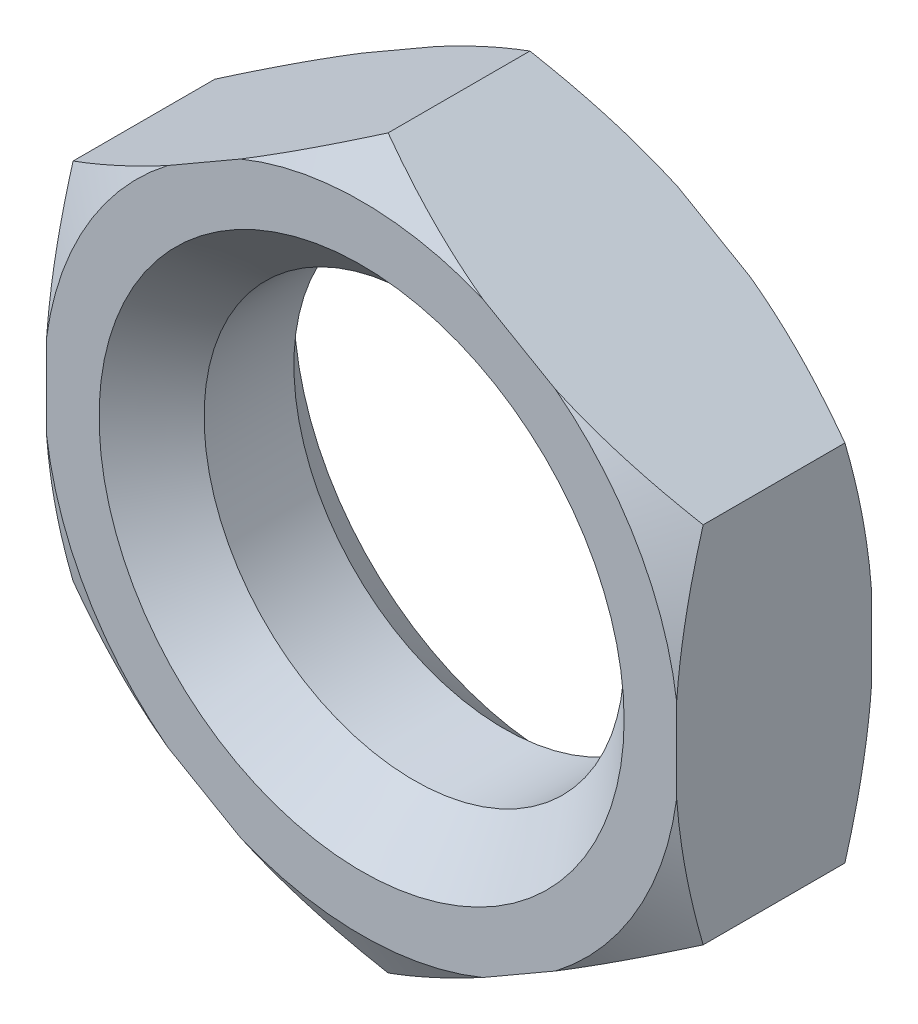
ISO-10303-21;
HEADER;
FILE_DESCRIPTION(('STEP AP214'),'2;1');
FILE_NAME('part.step','',(''),(''),'','','');
FILE_SCHEMA(('AUTOMOTIVE_DESIGN { 1 0 10303 214 1 1 1 1 }'));
ENDSEC;
DATA;
#1=APPLICATION_CONTEXT('core data for automotive mechanical design processes');
#2=APPLICATION_PROTOCOL_DEFINITION('international standard','automotive_design',2000,#1);
#3=PRODUCT_CONTEXT('',#1,'mechanical');
#4=PRODUCT('Part','Part','',(#3));
#5=PRODUCT_RELATED_PRODUCT_CATEGORY('part','',(#4));
#6=PRODUCT_DEFINITION_FORMATION('','',#4);
#7=PRODUCT_DEFINITION_CONTEXT('part definition',#1,'design');
#8=PRODUCT_DEFINITION('design','',#6,#7);
#9=PRODUCT_DEFINITION_SHAPE('','',#8);
#10=(LENGTH_UNIT() NAMED_UNIT(*) SI_UNIT(.MILLI.,.METRE.));
#11=(NAMED_UNIT(*) PLANE_ANGLE_UNIT() SI_UNIT($,.RADIAN.));
#12=(NAMED_UNIT(*) SI_UNIT($,.STERADIAN.) SOLID_ANGLE_UNIT());
#13=UNCERTAINTY_MEASURE_WITH_UNIT(LENGTH_MEASURE(1.E-05),#10,'distance_accuracy_value','');
#14=(GEOMETRIC_REPRESENTATION_CONTEXT(3) GLOBAL_UNCERTAINTY_ASSIGNED_CONTEXT((#13)) GLOBAL_UNIT_ASSIGNED_CONTEXT((#10,
#11,#12)) REPRESENTATION_CONTEXT('',''));
#15=CARTESIAN_POINT('',(0.,0.,0.));
#16=DIRECTION('',(0.,0.,1.));
#17=DIRECTION('',(1.,0.,0.));
#18=AXIS2_PLACEMENT_3D('',#15,#16,#17);
#19=CARTESIAN_POINT('',(12.,6.92820323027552,3.71));
#20=DIRECTION('',(-0.5,-0.866025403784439,0.));
#21=DIRECTION('',(0.866025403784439,-0.5,0.));
#22=AXIS2_PLACEMENT_3D('',#19,#20,#21);
#23=PLANE('',#22);
#24=CARTESIAN_POINT('',(-8.33611626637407,18.6692654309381,1.10477325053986));
#25=CARTESIAN_POINT('',(-7.95906383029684,18.4515741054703,0.901297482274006));
#26=CARTESIAN_POINT('',(-7.58110950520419,18.2333620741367,0.700015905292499));
#27=CARTESIAN_POINT('',(-6.82301676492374,17.7956770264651,0.302871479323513));
#28=CARTESIAN_POINT('',(-6.44287808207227,17.5762038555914,0.107009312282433));
#29=CARTESIAN_POINT('',(-5.67890758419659,17.1351252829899,-0.278832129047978));
#30=CARTESIAN_POINT('',(-5.29506783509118,16.9135153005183,-0.468790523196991));
#31=CARTESIAN_POINT('',(-4.52451367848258,16.4686356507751,-0.840749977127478));
#32=CARTESIAN_POINT('',(-4.13779936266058,16.2453660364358,-1.02275128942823));
#33=CARTESIAN_POINT('',(-3.3511489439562,15.7911932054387,-1.38156375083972));
#34=CARTESIAN_POINT('',(-2.95112688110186,15.5602403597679,-1.55812479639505));
#35=CARTESIAN_POINT('',(-2.14704869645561,15.0960056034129,-1.89867813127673));
#36=CARTESIAN_POINT('',(-1.7429923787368,14.8627235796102,-2.06266980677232));
#37=CARTESIAN_POINT('',(-0.930751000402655,14.393775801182,-2.37496459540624));
#38=CARTESIAN_POINT('',(-0.522570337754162,14.1581125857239,-2.52328281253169));
#39=CARTESIAN_POINT('',(0.298583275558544,13.6840193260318,-2.80080872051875));
#40=CARTESIAN_POINT('',(0.7115556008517,13.4455896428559,-2.93001887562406));
#41=CARTESIAN_POINT('',(1.69912405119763,12.8754167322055,-3.20949984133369));
#42=CARTESIAN_POINT('',(2.27602044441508,12.5423454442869,-3.34937837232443));
#43=CARTESIAN_POINT('',(3.14726656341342,12.0393312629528,-3.51753906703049));
#44=CARTESIAN_POINT('',(3.43865143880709,11.8711001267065,-3.56664842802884));
#45=CARTESIAN_POINT('',(4.0230571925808,11.5336933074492,-3.64975507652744));
#46=CARTESIAN_POINT('',(4.31607805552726,11.3645176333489,-3.68375250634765));
#47=CARTESIAN_POINT('',(4.89978169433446,11.0275161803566,-3.73535424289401));
#48=CARTESIAN_POINT('',(5.19045208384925,10.8596975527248,-3.75314441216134));
#49=CARTESIAN_POINT('',(5.77219928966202,10.5238256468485,-3.77247608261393));
#50=CARTESIAN_POINT('',(6.0632761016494,10.3557723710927,-3.77401775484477));
#51=CARTESIAN_POINT('',(6.6451486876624,10.0198280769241,-3.76080350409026));
#52=CARTESIAN_POINT('',(6.93594446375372,9.85193705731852,-3.74604770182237));
#53=CARTESIAN_POINT('',(7.51663794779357,9.51667351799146,-3.70068520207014));
#54=CARTESIAN_POINT('',(7.80653550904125,9.34930108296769,-3.67007603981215));
#55=CARTESIAN_POINT('',(8.49115690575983,8.95403473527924,-3.57984599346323));
#56=CARTESIAN_POINT('',(8.88524036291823,8.72651054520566,-3.51369656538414));
#57=CARTESIAN_POINT('',(9.669641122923,8.27363655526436,-3.35642715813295));
#58=CARTESIAN_POINT('',(10.0599578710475,8.04828707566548,-3.26530355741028));
#59=CARTESIAN_POINT('',(10.8367752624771,7.59979134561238,-3.06152529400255));
#60=CARTESIAN_POINT('',(11.2232710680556,7.37664788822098,-2.94884629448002));
#61=CARTESIAN_POINT('',(11.9919262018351,6.93286463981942,-2.70550759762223));
#62=CARTESIAN_POINT('',(12.3740858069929,6.71222468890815,-2.57484905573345));
#63=CARTESIAN_POINT('',(13.1388652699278,6.27067906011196,-2.29700896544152));
#64=CARTESIAN_POINT('',(13.5214360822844,6.04980169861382,-2.14964866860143));
#65=CARTESIAN_POINT('',(14.2825244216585,5.61038714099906,-1.84253657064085));
#66=CARTESIAN_POINT('',(14.6610444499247,5.39184850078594,-1.68279298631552));
#67=CARTESIAN_POINT('',(15.4146120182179,4.95677606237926,-1.35311952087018));
#68=CARTESIAN_POINT('',(15.789660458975,4.74024174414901,-1.18319237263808));
#69=CARTESIAN_POINT('',(16.5368587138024,4.30884663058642,-0.834906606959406));
#70=CARTESIAN_POINT('',(16.9090081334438,4.09398606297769,-0.656546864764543));
#71=CARTESIAN_POINT('',(17.5380979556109,3.73078088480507,-0.348101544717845));
#72=CARTESIAN_POINT('',(17.7956998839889,3.58205434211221,-0.219807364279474));
#73=CARTESIAN_POINT('',(18.3097706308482,3.28525545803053,0.0397458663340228));
#74=CARTESIAN_POINT('',(18.5662394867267,3.13718309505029,0.171004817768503));
#75=CARTESIAN_POINT('',(19.0754509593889,2.84318971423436,0.434733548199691));
#76=CARTESIAN_POINT('',(19.3282042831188,2.6972625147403,0.567175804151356));
#77=CARTESIAN_POINT('',(19.8328122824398,2.40592695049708,0.834337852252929));
#78=CARTESIAN_POINT('',(20.084666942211,2.26051859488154,0.969057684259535));
#79=CARTESIAN_POINT('',(20.3361162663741,2.11534425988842,1.10477325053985));
#80=B_SPLINE_CURVE_WITH_KNOTS('',3,(#24,#25,#26,#27,#28,#29,#30,#31,#32,#33,#34,#35,#36,#37,#38,
#39,#40,#41,#42,#43,#44,#45,#46,#47,#48,#49,#50,#51,#52,#53,#54,#55,#56,#57,#58,#59,#60,#61,#62,
#63,#64,#65,#66,#67,#68,#69,#70,#71,#72,#73,#74,#75,#76,#77,#78,#79),.UNSPECIFIED.,.F.,.F.,(4,2,
2,2,2,2,2,2,2,2,2,2,2,2,2,2,2,2,2,2,2,2,2,2,2,2,2,4),(0.,1.4417657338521,2.88371207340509,
4.33028259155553,5.77680716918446,7.26015892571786,8.74358307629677,10.2255644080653,
11.7073544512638,13.7471508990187,14.7669515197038,15.7867425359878,16.7946858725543,
17.8026185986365,18.8105438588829,19.8186258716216,21.1972856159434,22.5761453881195,
23.9565712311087,25.3369084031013,26.7337361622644,28.1296448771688,29.5251806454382,
30.9209030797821,31.8927101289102,32.8644848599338,33.8259733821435,34.7874787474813),.UNSPECIFIED.);
#81=CARTESIAN_POINT('',(0.,13.856406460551,-2.69963702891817));
#82=VERTEX_POINT('',#81);
#83=CARTESIAN_POINT('',(4.61298592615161,11.1930977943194,-3.71));
#84=VERTEX_POINT('',#83);
#85=EDGE_CURVE('E177',#82,#84,#80,.T.);
#86=ORIENTED_EDGE('',*,*,#85,.F.);
#87=DIRECTION('',(0.,0.,-1.));
#88=VECTOR('',#87,1.);
#89=CARTESIAN_POINT('',(0.,13.856406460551,3.71));
#90=LINE('',#89,#88);
#91=CARTESIAN_POINT('',(0.,13.856406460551,2.69963702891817));
#92=VERTEX_POINT('',#91);
#93=EDGE_CURVE('E223',#92,#82,#90,.T.);
#94=ORIENTED_EDGE('',*,*,#93,.F.);
#95=CARTESIAN_POINT('',(20.3361162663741,2.11534425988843,-1.10477325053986));
#96=CARTESIAN_POINT('',(19.9590638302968,2.33303558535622,-0.901297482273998));
#97=CARTESIAN_POINT('',(19.5811095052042,2.55124761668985,-0.700015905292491));
#98=CARTESIAN_POINT('',(18.8230167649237,2.98893266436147,-0.302871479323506));
#99=CARTESIAN_POINT('',(18.4428780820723,3.20840583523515,-0.107009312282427));
#100=CARTESIAN_POINT('',(17.6789075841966,3.64948440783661,0.278832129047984));
#101=CARTESIAN_POINT('',(17.2950678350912,3.87109439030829,0.468790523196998));
#102=CARTESIAN_POINT('',(16.5245136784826,4.31597404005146,0.840749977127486));
#103=CARTESIAN_POINT('',(16.1377993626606,4.53924365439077,1.02275128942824));
#104=CARTESIAN_POINT('',(15.3511489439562,4.99341648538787,1.38156375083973));
#105=CARTESIAN_POINT('',(14.9511268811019,5.22436933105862,1.55812479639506));
#106=CARTESIAN_POINT('',(14.1470486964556,5.68860408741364,1.89867813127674));
#107=CARTESIAN_POINT('',(13.7429923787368,5.92188611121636,2.06266980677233));
#108=CARTESIAN_POINT('',(12.9307510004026,6.39083388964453,2.37496459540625));
#109=CARTESIAN_POINT('',(12.5225703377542,6.62649710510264,2.5232828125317));
#110=CARTESIAN_POINT('',(11.7014167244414,7.10059036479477,2.80080872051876));
#111=CARTESIAN_POINT('',(11.2884443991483,7.33902004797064,2.93001887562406));
#112=CARTESIAN_POINT('',(10.3008759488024,7.90919295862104,3.20949984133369));
#113=CARTESIAN_POINT('',(9.72397955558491,8.24226424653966,3.34937837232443));
#114=CARTESIAN_POINT('',(8.85273343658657,8.74527842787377,3.51753906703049));
#115=CARTESIAN_POINT('',(8.56134856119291,8.91350956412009,3.56664842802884));
#116=CARTESIAN_POINT('',(7.97694280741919,9.25091638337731,3.64975507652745));
#117=CARTESIAN_POINT('',(7.68392194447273,9.42009205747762,3.68375250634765));
#118=CARTESIAN_POINT('',(7.10021830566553,9.75709351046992,3.73535424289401));
#119=CARTESIAN_POINT('',(6.80954791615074,9.92491213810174,3.75314441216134));
#120=CARTESIAN_POINT('',(6.22780071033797,10.2607840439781,3.77247608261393));
#121=CARTESIAN_POINT('',(5.9367238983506,10.4288373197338,3.77401775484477));
#122=CARTESIAN_POINT('',(5.3548513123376,10.7647816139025,3.76080350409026));
#123=CARTESIAN_POINT('',(5.06405553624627,10.932672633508,3.74604770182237));
#124=CARTESIAN_POINT('',(4.48336205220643,11.2679361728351,3.70068520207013));
#125=CARTESIAN_POINT('',(4.19346449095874,11.4353086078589,3.67007603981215));
#126=CARTESIAN_POINT('',(3.50884309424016,11.8305749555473,3.57984599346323));
#127=CARTESIAN_POINT('',(3.11475963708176,12.0580991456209,3.51369656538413));
#128=CARTESIAN_POINT('',(2.33035887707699,12.5109731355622,3.35642715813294));
#129=CARTESIAN_POINT('',(1.94004212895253,12.7363226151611,3.26530355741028));
#130=CARTESIAN_POINT('',(1.16322473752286,13.1848183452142,3.06152529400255));
#131=CARTESIAN_POINT('',(0.776728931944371,13.4079618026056,2.94884629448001));
#132=CARTESIAN_POINT('',(0.00807379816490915,13.8517450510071,2.70550759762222));
#133=CARTESIAN_POINT('',(-0.37408580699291,14.0723850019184,2.57484905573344));
#134=CARTESIAN_POINT('',(-1.13886526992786,14.5139306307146,2.29700896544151));
#135=CARTESIAN_POINT('',(-1.5214360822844,14.7348079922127,2.14964866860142));
#136=CARTESIAN_POINT('',(-2.28252442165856,15.1742225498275,1.84253657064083));
#137=CARTESIAN_POINT('',(-2.66104444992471,15.3927611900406,1.68279298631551));
#138=CARTESIAN_POINT('',(-3.41461201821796,15.8278336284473,1.35311952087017));
#139=CARTESIAN_POINT('',(-3.78966045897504,16.0443679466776,1.18319237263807));
#140=CARTESIAN_POINT('',(-4.5368587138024,16.4757630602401,0.834906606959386));
#141=CARTESIAN_POINT('',(-4.9090081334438,16.6906236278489,0.656546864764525));
#142=CARTESIAN_POINT('',(-5.53809795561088,17.0538288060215,0.348101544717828));
#143=CARTESIAN_POINT('',(-5.79569988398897,17.2025553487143,0.219807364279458));
#144=CARTESIAN_POINT('',(-6.30977063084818,17.499354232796,-0.0397458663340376));
#145=CARTESIAN_POINT('',(-6.56623948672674,17.6474265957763,-0.171004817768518));
#146=CARTESIAN_POINT('',(-7.07545095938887,17.9414199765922,-0.434733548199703));
#147=CARTESIAN_POINT('',(-7.32820428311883,18.0873471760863,-0.567175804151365));
#148=CARTESIAN_POINT('',(-7.83281228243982,18.3786827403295,-0.834337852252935));
#149=CARTESIAN_POINT('',(-8.08466694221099,18.524091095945,-0.969057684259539));
#150=CARTESIAN_POINT('',(-8.33611626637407,18.6692654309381,-1.10477325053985));
#151=B_SPLINE_CURVE_WITH_KNOTS('',3,(#95,#96,#97,#98,#99,#100,#101,#102,#103,#104,#105,#106,
#107,#108,#109,#110,#111,#112,#113,#114,#115,#116,#117,#118,#119,#120,#121,#122,#123,#124,#125,
#126,#127,#128,#129,#130,#131,#132,#133,#134,#135,#136,#137,#138,#139,#140,#141,#142,#143,#144,
#145,#146,#147,#148,#149,#150),.UNSPECIFIED.,.F.,.F.,(4,2,2,2,2,2,2,2,2,2,2,2,2,2,2,2,2,2,2,2,2,
2,2,2,2,2,2,4),(0.,1.4417657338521,2.88371207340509,4.33028259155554,5.77680716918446,
7.26015892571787,8.74358307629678,10.2255644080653,11.7073544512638,13.7471508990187,
14.7669515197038,15.7867425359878,16.7946858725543,17.8026185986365,18.8105438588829,
19.8186258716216,21.1972856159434,22.5761453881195,23.9565712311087,25.3369084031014,
26.7337361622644,28.1296448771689,29.5251806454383,30.9209030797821,31.8927101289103,
32.8644848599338,33.8259733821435,34.7874787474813),.UNSPECIFIED.);
#152=CARTESIAN_POINT('',(4.61298592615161,11.1930977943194,3.71));
#153=VERTEX_POINT('',#152);
#154=EDGE_CURVE('E374',#153,#92,#151,.T.);
#155=ORIENTED_EDGE('',*,*,#154,.F.);
#156=DIRECTION('',(-0.866025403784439,0.5,0.));
#157=VECTOR('',#156,1.);
#158=CARTESIAN_POINT('',(12.,6.92820323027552,3.71));
#159=LINE('',#158,#157);
#160=CARTESIAN_POINT('',(7.3870140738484,9.5915118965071,3.71));
#161=VERTEX_POINT('',#160);
#162=EDGE_CURVE('E352',#161,#153,#159,.T.);
#163=ORIENTED_EDGE('',*,*,#162,.F.);
#164=CARTESIAN_POINT('',(12.,6.92820323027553,2.69963702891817));
#165=VERTEX_POINT('',#164);
#166=EDGE_CURVE('E194',#165,#161,#151,.T.);
#167=ORIENTED_EDGE('',*,*,#166,.F.);
#168=DIRECTION('',(0.,0.,-1.));
#169=VECTOR('',#168,1.);
#170=CARTESIAN_POINT('',(12.,6.92820323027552,3.71));
#171=LINE('',#170,#169);
#172=CARTESIAN_POINT('',(12.,6.92820323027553,-2.69963702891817));
#173=VERTEX_POINT('',#172);
#174=EDGE_CURVE('E183',#165,#173,#171,.T.);
#175=ORIENTED_EDGE('',*,*,#174,.T.);
#176=CARTESIAN_POINT('',(7.3870140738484,9.5915118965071,-3.71));
#177=VERTEX_POINT('',#176);
#178=EDGE_CURVE('E164',#177,#173,#80,.T.);
#179=ORIENTED_EDGE('',*,*,#178,.F.);
#180=DIRECTION('',(-0.866025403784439,0.5,0.));
#181=VECTOR('',#180,1.);
#182=CARTESIAN_POINT('',(12.,6.92820323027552,-3.71));
#183=LINE('',#182,#181);
#184=EDGE_CURVE('E266',#177,#84,#183,.T.);
#185=ORIENTED_EDGE('',*,*,#184,.T.);
#186=EDGE_LOOP('',(#86,#94,#155,#163,#167,#175,#179,#185));
#187=FACE_BOUND('',#186,.T.);
#188=ADVANCED_FACE('F39',(#187),#23,.F.);
#189=CARTESIAN_POINT('',(0.,13.856406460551,3.71));
#190=DIRECTION('',(0.5,-0.866025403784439,0.));
#191=DIRECTION('',(0.866025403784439,0.5,0.));
#192=AXIS2_PLACEMENT_3D('',#189,#190,#191);
#193=PLANE('',#192);
#194=CARTESIAN_POINT('',(-20.3361162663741,2.11534425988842,1.10477325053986));
#195=CARTESIAN_POINT('',(-19.9590638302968,2.33303558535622,0.901297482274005));
#196=CARTESIAN_POINT('',(-19.5811095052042,2.55124761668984,0.700015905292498));
#197=CARTESIAN_POINT('',(-18.8230167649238,2.98893266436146,0.302871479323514));
#198=CARTESIAN_POINT('',(-18.4428780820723,3.20840583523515,0.107009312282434));
#199=CARTESIAN_POINT('',(-17.6789075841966,3.6494844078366,-0.278832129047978));
#200=CARTESIAN_POINT('',(-17.2950678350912,3.87109439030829,-0.468790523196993));
#201=CARTESIAN_POINT('',(-16.5245136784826,4.31597404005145,-0.840749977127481));
#202=CARTESIAN_POINT('',(-16.1377993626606,4.53924365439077,-1.02275128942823));
#203=CARTESIAN_POINT('',(-15.3511489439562,4.99341648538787,-1.38156375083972));
#204=CARTESIAN_POINT('',(-14.9511268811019,5.22436933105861,-1.55812479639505));
#205=CARTESIAN_POINT('',(-14.1470486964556,5.68860408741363,-1.89867813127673));
#206=CARTESIAN_POINT('',(-13.7429923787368,5.92188611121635,-2.06266980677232));
#207=CARTESIAN_POINT('',(-12.9307510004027,6.39083388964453,-2.37496459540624));
#208=CARTESIAN_POINT('',(-12.5225703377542,6.62649710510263,-2.52328281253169));
#209=CARTESIAN_POINT('',(-11.7014167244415,7.10059036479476,-2.80080872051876));
#210=CARTESIAN_POINT('',(-11.2884443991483,7.33902004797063,-2.93001887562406));
#211=CARTESIAN_POINT('',(-10.3008759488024,7.90919295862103,-3.20949984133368));
#212=CARTESIAN_POINT('',(-9.72397955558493,8.24226424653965,-3.34937837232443));
#213=CARTESIAN_POINT('',(-8.85273343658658,8.74527842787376,-3.51753906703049));
#214=CARTESIAN_POINT('',(-8.56134856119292,8.91350956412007,-3.56664842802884));
#215=CARTESIAN_POINT('',(-7.97694280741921,9.25091638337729,-3.64975507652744));
#216=CARTESIAN_POINT('',(-7.68392194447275,9.42009205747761,-3.68375250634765));
#217=CARTESIAN_POINT('',(-7.10021830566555,9.75709351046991,-3.73535424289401));
#218=CARTESIAN_POINT('',(-6.80954791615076,9.92491213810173,-3.75314441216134));
#219=CARTESIAN_POINT('',(-6.22780071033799,10.260784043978,-3.77247608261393));
#220=CARTESIAN_POINT('',(-5.93672389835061,10.4288373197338,-3.77401775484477));
#221=CARTESIAN_POINT('',(-5.35485131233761,10.7647816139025,-3.76080350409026));
#222=CARTESIAN_POINT('',(-5.06405553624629,10.932672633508,-3.74604770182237));
#223=CARTESIAN_POINT('',(-4.48336205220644,11.2679361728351,-3.70068520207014));
#224=CARTESIAN_POINT('',(-4.19346449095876,11.4353086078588,-3.67007603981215));
#225=CARTESIAN_POINT('',(-3.50884309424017,11.8305749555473,-3.57984599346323));
#226=CARTESIAN_POINT('',(-3.11475963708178,12.0580991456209,-3.51369656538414));
#227=CARTESIAN_POINT('',(-2.33035887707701,12.5109731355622,-3.35642715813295));
#228=CARTESIAN_POINT('',(-1.94004212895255,12.7363226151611,-3.26530355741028));
#229=CARTESIAN_POINT('',(-1.16322473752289,13.1848183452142,-3.06152529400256));
#230=CARTESIAN_POINT('',(-0.776728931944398,13.4079618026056,-2.94884629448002));
#231=CARTESIAN_POINT('',(-0.00807379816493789,13.8517450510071,-2.70550759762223));
#232=CARTESIAN_POINT('',(0.374085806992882,14.0723850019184,-2.57484905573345));
#233=CARTESIAN_POINT('',(1.13886526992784,14.5139306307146,-2.29700896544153));
#234=CARTESIAN_POINT('',(1.52143608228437,14.7348079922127,-2.14964866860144));
#235=CARTESIAN_POINT('',(2.28252442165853,15.1742225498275,-1.84253657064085));
#236=CARTESIAN_POINT('',(2.66104444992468,15.3927611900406,-1.68279298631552));
#237=CARTESIAN_POINT('',(3.41461201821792,15.8278336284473,-1.35311952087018));
#238=CARTESIAN_POINT('',(3.78966045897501,16.0443679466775,-1.18319237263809));
#239=CARTESIAN_POINT('',(4.53685871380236,16.4757630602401,-0.834906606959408));
#240=CARTESIAN_POINT('',(4.90900813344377,16.6906236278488,-0.656546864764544));
#241=CARTESIAN_POINT('',(5.53809795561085,17.0538288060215,-0.348101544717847));
#242=CARTESIAN_POINT('',(5.79569988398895,17.2025553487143,-0.219807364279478));
#243=CARTESIAN_POINT('',(6.30977063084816,17.499354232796,0.0397458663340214));
#244=CARTESIAN_POINT('',(6.56623948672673,17.6474265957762,0.171004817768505));
#245=CARTESIAN_POINT('',(7.07545095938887,17.9414199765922,0.434733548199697));
#246=CARTESIAN_POINT('',(7.32820428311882,18.0873471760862,0.567175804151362));
#247=CARTESIAN_POINT('',(7.83281228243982,18.3786827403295,0.834337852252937));
#248=CARTESIAN_POINT('',(8.084666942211,18.524091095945,0.969057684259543));
#249=CARTESIAN_POINT('',(8.33611626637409,18.6692654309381,1.10477325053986));
#250=B_SPLINE_CURVE_WITH_KNOTS('',3,(#194,#195,#196,#197,#198,#199,#200,#201,#202,#203,#204,
#205,#206,#207,#208,#209,#210,#211,#212,#213,#214,#215,#216,#217,#218,#219,#220,#221,#222,#223,
#224,#225,#226,#227,#228,#229,#230,#231,#232,#233,#234,#235,#236,#237,#238,#239,#240,#241,#242,
#243,#244,#245,#246,#247,#248,#249),.UNSPECIFIED.,.F.,.F.,(4,2,2,2,2,2,2,2,2,2,2,2,2,2,2,2,2,2,
2,2,2,2,2,2,2,2,2,4),(0.,1.4417657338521,2.88371207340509,4.33028259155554,5.77680716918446,
7.26015892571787,8.74358307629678,10.2255644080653,11.7073544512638,13.7471508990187,
14.7669515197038,15.7867425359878,16.7946858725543,17.8026185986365,18.8105438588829,
19.8186258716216,21.1972856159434,22.5761453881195,23.9565712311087,25.3369084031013,
26.7337361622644,28.1296448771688,29.5251806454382,30.9209030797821,31.8927101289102,
32.8644848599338,33.8259733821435,34.7874787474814),.UNSPECIFIED.);
#251=CARTESIAN_POINT('',(-12.,6.92820323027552,-2.69963702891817));
#252=VERTEX_POINT('',#251);
#253=CARTESIAN_POINT('',(-7.38701407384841,9.59151189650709,-3.71));
#254=VERTEX_POINT('',#253);
#255=EDGE_CURVE('E55',#252,#254,#250,.T.);
#256=ORIENTED_EDGE('',*,*,#255,.F.);
#257=DIRECTION('',(0.,0.,-1.));
#258=VECTOR('',#257,1.);
#259=CARTESIAN_POINT('',(-12.,6.92820323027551,3.71));
#260=LINE('',#259,#258);
#261=CARTESIAN_POINT('',(-12.,6.92820323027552,2.69963702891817));
#262=VERTEX_POINT('',#261);
#263=EDGE_CURVE('E219',#262,#252,#260,.T.);
#264=ORIENTED_EDGE('',*,*,#263,.F.);
#265=CARTESIAN_POINT('',(8.33611626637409,18.6692654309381,-1.10477325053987));
#266=CARTESIAN_POINT('',(7.95906383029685,18.4515741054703,-0.901297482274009));
#267=CARTESIAN_POINT('',(7.58110950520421,18.2333620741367,-0.700015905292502));
#268=CARTESIAN_POINT('',(6.82301676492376,17.7956770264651,-0.302871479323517));
#269=CARTESIAN_POINT('',(6.44287808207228,17.5762038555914,-0.107009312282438));
#270=CARTESIAN_POINT('',(5.6789075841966,17.1351252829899,0.278832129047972));
#271=CARTESIAN_POINT('',(5.2950678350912,16.9135153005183,0.468790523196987));
#272=CARTESIAN_POINT('',(4.52451367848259,16.4686356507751,0.840749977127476));
#273=CARTESIAN_POINT('',(4.13779936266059,16.2453660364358,1.02275128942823));
#274=CARTESIAN_POINT('',(3.35114894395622,15.7911932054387,1.38156375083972));
#275=CARTESIAN_POINT('',(2.95112688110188,15.5602403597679,1.55812479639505));
#276=CARTESIAN_POINT('',(2.14704869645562,15.0960056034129,1.89867813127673));
#277=CARTESIAN_POINT('',(1.74299237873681,14.8627235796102,2.06266980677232));
#278=CARTESIAN_POINT('',(0.930751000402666,14.393775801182,2.37496459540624));
#279=CARTESIAN_POINT('',(0.522570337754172,14.1581125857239,2.52328281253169));
#280=CARTESIAN_POINT('',(-0.298583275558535,13.6840193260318,2.80080872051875));
#281=CARTESIAN_POINT('',(-0.711555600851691,13.4455896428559,2.93001887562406));
#282=CARTESIAN_POINT('',(-1.69912405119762,12.8754167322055,3.20949984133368));
#283=CARTESIAN_POINT('',(-2.27602044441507,12.5423454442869,3.34937837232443));
#284=CARTESIAN_POINT('',(-3.14726656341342,12.0393312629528,3.51753906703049));
#285=CARTESIAN_POINT('',(-3.43865143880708,11.8711001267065,3.56664842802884));
#286=CARTESIAN_POINT('',(-4.02305719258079,11.5336933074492,3.64975507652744));
#287=CARTESIAN_POINT('',(-4.31607805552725,11.3645176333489,3.68375250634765));
#288=CARTESIAN_POINT('',(-4.89978169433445,11.0275161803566,3.73535424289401));
#289=CARTESIAN_POINT('',(-5.19045208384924,10.8596975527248,3.75314441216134));
#290=CARTESIAN_POINT('',(-5.77219928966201,10.5238256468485,3.77247608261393));
#291=CARTESIAN_POINT('',(-6.06327610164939,10.3557723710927,3.77401775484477));
#292=CARTESIAN_POINT('',(-6.64514868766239,10.0198280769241,3.76080350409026));
#293=CARTESIAN_POINT('',(-6.93594446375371,9.85193705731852,3.74604770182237));
#294=CARTESIAN_POINT('',(-7.51663794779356,9.51667351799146,3.70068520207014));
#295=CARTESIAN_POINT('',(-7.80653550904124,9.34930108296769,3.67007603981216));
#296=CARTESIAN_POINT('',(-8.49115690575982,8.95403473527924,3.57984599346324));
#297=CARTESIAN_POINT('',(-8.88524036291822,8.72651054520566,3.51369656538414));
#298=CARTESIAN_POINT('',(-9.66964112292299,8.27363655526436,3.35642715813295));
#299=CARTESIAN_POINT('',(-10.0599578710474,8.04828707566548,3.26530355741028));
#300=CARTESIAN_POINT('',(-10.8367752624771,7.59979134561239,3.06152529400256));
#301=CARTESIAN_POINT('',(-11.2232710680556,7.37664788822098,2.94884629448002));
#302=CARTESIAN_POINT('',(-11.9919262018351,6.93286463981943,2.70550759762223));
#303=CARTESIAN_POINT('',(-12.3740858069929,6.71222468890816,2.57484905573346));
#304=CARTESIAN_POINT('',(-13.1388652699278,6.27067906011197,2.29700896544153));
#305=CARTESIAN_POINT('',(-13.5214360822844,6.04980169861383,2.14964866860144));
#306=CARTESIAN_POINT('',(-14.2825244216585,5.61038714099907,1.84253657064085));
#307=CARTESIAN_POINT('',(-14.6610444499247,5.39184850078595,1.68279298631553));
#308=CARTESIAN_POINT('',(-15.4146120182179,4.95677606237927,1.35311952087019));
#309=CARTESIAN_POINT('',(-15.789660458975,4.74024174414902,1.18319237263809));
#310=CARTESIAN_POINT('',(-16.5368587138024,4.30884663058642,0.834906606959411));
#311=CARTESIAN_POINT('',(-16.9090081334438,4.0939860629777,0.656546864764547));
#312=CARTESIAN_POINT('',(-17.5380979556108,3.73078088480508,0.348101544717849));
#313=CARTESIAN_POINT('',(-17.7956998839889,3.58205434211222,0.21980736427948));
#314=CARTESIAN_POINT('',(-18.3097706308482,3.28525545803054,-0.0397458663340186));
#315=CARTESIAN_POINT('',(-18.5662394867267,3.13718309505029,-0.171004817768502));
#316=CARTESIAN_POINT('',(-19.0754509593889,2.84318971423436,-0.434733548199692));
#317=CARTESIAN_POINT('',(-19.3282042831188,2.6972625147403,-0.567175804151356));
#318=CARTESIAN_POINT('',(-19.8328122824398,2.40592695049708,-0.834337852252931));
#319=CARTESIAN_POINT('',(-20.084666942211,2.26051859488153,-0.969057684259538));
#320=CARTESIAN_POINT('',(-20.3361162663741,2.11534425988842,-1.10477325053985));
#321=B_SPLINE_CURVE_WITH_KNOTS('',3,(#265,#266,#267,#268,#269,#270,#271,#272,#273,#274,#275,
#276,#277,#278,#279,#280,#281,#282,#283,#284,#285,#286,#287,#288,#289,#290,#291,#292,#293,#294,
#295,#296,#297,#298,#299,#300,#301,#302,#303,#304,#305,#306,#307,#308,#309,#310,#311,#312,#313,
#314,#315,#316,#317,#318,#319,#320),.UNSPECIFIED.,.F.,.F.,(4,2,2,2,2,2,2,2,2,2,2,2,2,2,2,2,2,2,
2,2,2,2,2,2,2,2,2,4),(0.,1.4417657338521,2.88371207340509,4.33028259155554,5.77680716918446,
7.26015892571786,8.74358307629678,10.2255644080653,11.7073544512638,13.7471508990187,
14.7669515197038,15.7867425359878,16.7946858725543,17.8026185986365,18.8105438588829,
19.8186258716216,21.1972856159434,22.5761453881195,23.9565712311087,25.3369084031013,
26.7337361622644,28.1296448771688,29.5251806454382,30.9209030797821,31.8927101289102,
32.8644848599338,33.8259733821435,34.7874787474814),.UNSPECIFIED.);
#322=CARTESIAN_POINT('',(-7.38701407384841,9.59151189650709,3.71));
#323=VERTEX_POINT('',#322);
#324=EDGE_CURVE('E345',#323,#262,#321,.T.);
#325=ORIENTED_EDGE('',*,*,#324,.F.);
#326=DIRECTION('',(-0.866025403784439,-0.5,0.));
#327=VECTOR('',#326,1.);
#328=CARTESIAN_POINT('',(0.,13.856406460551,3.71));
#329=LINE('',#328,#327);
#330=CARTESIAN_POINT('',(-4.6129859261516,11.1930977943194,3.71));
#331=VERTEX_POINT('',#330);
#332=EDGE_CURVE('E356',#331,#323,#329,.T.);
#333=ORIENTED_EDGE('',*,*,#332,.F.);
#334=EDGE_CURVE('E351',#92,#331,#321,.T.);
#335=ORIENTED_EDGE('',*,*,#334,.F.);
#336=ORIENTED_EDGE('',*,*,#93,.T.);
#337=CARTESIAN_POINT('',(-4.6129859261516,11.1930977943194,-3.71));
#338=VERTEX_POINT('',#337);
#339=EDGE_CURVE('E462',#338,#82,#250,.T.);
#340=ORIENTED_EDGE('',*,*,#339,.F.);
#341=DIRECTION('',(-0.866025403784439,-0.5,0.));
#342=VECTOR('',#341,1.);
#343=CARTESIAN_POINT('',(0.,13.856406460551,-3.71));
#344=LINE('',#343,#342);
#345=EDGE_CURVE('E373',#338,#254,#344,.T.);
#346=ORIENTED_EDGE('',*,*,#345,.T.);
#347=EDGE_LOOP('',(#256,#264,#325,#333,#335,#336,#340,#346));
#348=FACE_BOUND('',#347,.T.);
#349=ADVANCED_FACE('F325',(#348),#193,.F.);
#350=CARTESIAN_POINT('',(-12.,6.92820323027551,3.71));
#351=DIRECTION('',(1.,0.,0.));
#352=DIRECTION('',(0.,0.,-1.));
#353=AXIS2_PLACEMENT_3D('',#350,#351,#352);
#354=PLANE('',#353);
#355=CARTESIAN_POINT('',(-12.,-15.2643194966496,0.510469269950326));
#356=CARTESIAN_POINT('',(-12.,-14.8307695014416,0.313739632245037));
#357=CARTESIAN_POINT('',(-12.,-14.3960340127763,0.119572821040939));
#358=CARTESIAN_POINT('',(-12.,-13.5236842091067,-0.262391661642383));
#359=CARTESIAN_POINT('',(-12.,-13.0860693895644,-0.450188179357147));
#360=CARTESIAN_POINT('',(-12.,-12.2057757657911,-0.818864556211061));
#361=CARTESIAN_POINT('',(-12.,-11.7630834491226,-0.999712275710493));
#362=CARTESIAN_POINT('',(-12.,-10.8739576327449,-1.35194050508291));
#363=CARTESIAN_POINT('',(-12.,-10.4275243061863,-1.5233214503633));
#364=CARTESIAN_POINT('',(-12.,-9.53236451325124,-1.85377035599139));
#365=CARTESIAN_POINT('',(-12.,-9.08365715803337,-2.01288982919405));
#366=CARTESIAN_POINT('',(-12.,-8.18144700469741,-2.31707627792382));
#367=CARTESIAN_POINT('',(-12.,-7.72794397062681,-2.46214255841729));
#368=CARTESIAN_POINT('',(-12.,-6.81635642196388,-2.73490250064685));
#369=CARTESIAN_POINT('',(-12.,-6.35827873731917,-2.8626188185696));
#370=CARTESIAN_POINT('',(-12.,-5.43682219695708,-3.09726399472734));
#371=CARTESIAN_POINT('',(-12.,-4.97344409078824,-3.2041957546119));
#372=CARTESIAN_POINT('',(-12.,-4.17354794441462,-3.36658979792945));
#373=CARTESIAN_POINT('',(-12.,-3.83824773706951,-3.42805336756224));
#374=CARTESIAN_POINT('',(-12.,-3.16535483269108,-3.53688143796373));
#375=CARTESIAN_POINT('',(-12.,-2.82776220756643,-3.58424637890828));
#376=CARTESIAN_POINT('',(-12.,-2.15084908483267,-3.66362527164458));
#377=CARTESIAN_POINT('',(-12.,-1.81152904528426,-3.69564309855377));
#378=CARTESIAN_POINT('',(-12.,-1.13173577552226,-3.74341596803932));
#379=CARTESIAN_POINT('',(-12.,-0.791262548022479,-3.75917104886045));
#380=CARTESIAN_POINT('',(-12.,-0.110125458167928,-3.77392713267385));
#381=CARTESIAN_POINT('',(-12.,0.230538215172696,-3.7729367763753));
#382=CARTESIAN_POINT('',(-12.,0.911400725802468,-3.75425471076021));
#383=CARTESIAN_POINT('',(-12.,1.25159956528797,-3.73656308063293));
#384=CARTESIAN_POINT('',(-12.,1.93079619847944,-3.68501871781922));
#385=CARTESIAN_POINT('',(-12.,2.26979386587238,-3.65116433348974));
#386=CARTESIAN_POINT('',(-12.,2.94591779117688,-3.56826900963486));
#387=CARTESIAN_POINT('',(-12.,3.28304397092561,-3.51922744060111));
#388=CARTESIAN_POINT('',(-12.,4.12312729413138,-3.37917853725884));
#389=CARTESIAN_POINT('',(-12.,4.62463764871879,-3.27945205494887));
#390=CARTESIAN_POINT('',(-12.,5.62164129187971,-3.05345513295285));
#391=CARTESIAN_POINT('',(-12.,6.11713321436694,-2.9271787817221));
#392=CARTESIAN_POINT('',(-12.,7.1030837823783,-2.65254896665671));
#393=CARTESIAN_POINT('',(-12.,7.59352885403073,-2.50414723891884));
#394=CARTESIAN_POINT('',(-12.,8.56863495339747,-2.18968320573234));
#395=CARTESIAN_POINT('',(-12.,9.05329638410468,-2.02362213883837));
#396=CARTESIAN_POINT('',(-12.,10.0230224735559,-1.67531366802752));
#397=CARTESIAN_POINT('',(-12.,10.5080278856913,-1.49290232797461));
#398=CARTESIAN_POINT('',(-12.,11.4735008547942,-1.11641336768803));
#399=CARTESIAN_POINT('',(-12.,11.9539681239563,-0.922335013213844));
#400=CARTESIAN_POINT('',(-12.,12.9080081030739,-0.52601711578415));
#401=CARTESIAN_POINT('',(-12.,13.3816051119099,-0.323835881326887));
#402=CARTESIAN_POINT('',(-12.,14.08946203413,-0.0149260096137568));
#403=CARTESIAN_POINT('',(-12.,14.3249641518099,0.0889712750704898));
#404=CARTESIAN_POINT('',(-12.,14.7952005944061,0.298478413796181));
#405=CARTESIAN_POINT('',(-12.,15.0299349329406,0.404088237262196));
#406=CARTESIAN_POINT('',(-12.,15.2643194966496,0.510469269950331));
#407=B_SPLINE_CURVE_WITH_KNOTS('',3,(#355,#356,#357,#358,#359,#360,#361,#362,#363,#364,#365,
#366,#367,#368,#369,#370,#371,#372,#373,#374,#375,#376,#377,#378,#379,#380,#381,#382,#383,#384,
#385,#386,#387,#388,#389,#390,#391,#392,#393,#394,#395,#396,#397,#398,#399,#400,#401,#402,#403,
#404,#405,#406),.UNSPECIFIED.,.F.,.F.,(4,2,2,2,2,2,2,2,2,2,2,2,2,2,2,2,2,2,2,2,2,2,2,2,2,4),(0.,
1.42831270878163,2.85688274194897,4.29141523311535,5.72588169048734,7.15394963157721,
8.58208816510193,10.0083434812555,11.4343995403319,12.4568002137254,13.4791689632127,
14.5012794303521,15.5233874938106,16.5449681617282,17.5665439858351,18.5882242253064,
19.6099468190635,21.1430117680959,22.6764184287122,24.2132203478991,25.7499145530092,
27.3042502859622,28.8586839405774,30.4034435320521,31.1756447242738,31.9478321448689),.UNSPECIFIED.);
#408=CARTESIAN_POINT('',(-12.,-6.9282032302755,-2.69963702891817));
#409=VERTEX_POINT('',#408);
#410=CARTESIAN_POINT('',(-12.,-1.6015858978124,-3.71));
#411=VERTEX_POINT('',#410);
#412=EDGE_CURVE('E63',#409,#411,#407,.T.);
#413=ORIENTED_EDGE('',*,*,#412,.F.);
#414=DIRECTION('',(0.,0.,-1.));
#415=VECTOR('',#414,1.);
#416=CARTESIAN_POINT('',(-12.,-6.92820323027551,3.71));
#417=LINE('',#416,#415);
#418=CARTESIAN_POINT('',(-12.,-6.9282032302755,2.69963702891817));
#419=VERTEX_POINT('',#418);
#420=EDGE_CURVE('E215',#419,#409,#417,.T.);
#421=ORIENTED_EDGE('',*,*,#420,.F.);
#422=CARTESIAN_POINT('',(-12.,15.2643194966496,-0.51046926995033));
#423=CARTESIAN_POINT('',(-12.,14.8307695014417,-0.313739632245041));
#424=CARTESIAN_POINT('',(-12.,14.3960340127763,-0.119572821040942));
#425=CARTESIAN_POINT('',(-12.,13.5236842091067,0.262391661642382));
#426=CARTESIAN_POINT('',(-12.,13.0860693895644,0.450188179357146));
#427=CARTESIAN_POINT('',(-12.,12.2057757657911,0.818864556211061));
#428=CARTESIAN_POINT('',(-12.,11.7630834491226,0.999712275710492));
#429=CARTESIAN_POINT('',(-12.,10.8739576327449,1.35194050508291));
#430=CARTESIAN_POINT('',(-12.,10.4275243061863,1.5233214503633));
#431=CARTESIAN_POINT('',(-12.,9.53236451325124,1.85377035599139));
#432=CARTESIAN_POINT('',(-12.,9.08365715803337,2.01288982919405));
#433=CARTESIAN_POINT('',(-12.,8.18144700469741,2.31707627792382));
#434=CARTESIAN_POINT('',(-12.,7.72794397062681,2.46214255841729));
#435=CARTESIAN_POINT('',(-12.,6.81635642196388,2.73490250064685));
#436=CARTESIAN_POINT('',(-12.,6.35827873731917,2.8626188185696));
#437=CARTESIAN_POINT('',(-12.,5.43682219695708,3.09726399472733));
#438=CARTESIAN_POINT('',(-12.,4.97344409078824,3.2041957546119));
#439=CARTESIAN_POINT('',(-12.,4.17354794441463,3.36658979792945));
#440=CARTESIAN_POINT('',(-12.,3.83824773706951,3.42805336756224));
#441=CARTESIAN_POINT('',(-12.,3.16535483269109,3.53688143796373));
#442=CARTESIAN_POINT('',(-12.,2.82776220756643,3.58424637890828));
#443=CARTESIAN_POINT('',(-12.,2.15084908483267,3.66362527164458));
#444=CARTESIAN_POINT('',(-12.,1.81152904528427,3.69564309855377));
#445=CARTESIAN_POINT('',(-12.,1.13173577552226,3.74341596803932));
#446=CARTESIAN_POINT('',(-12.,0.79126254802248,3.75917104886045));
#447=CARTESIAN_POINT('',(-12.,0.110125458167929,3.77392713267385));
#448=CARTESIAN_POINT('',(-12.,-0.230538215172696,3.7729367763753));
#449=CARTESIAN_POINT('',(-12.,-0.911400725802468,3.75425471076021));
#450=CARTESIAN_POINT('',(-12.,-1.25159956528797,3.73656308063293));
#451=CARTESIAN_POINT('',(-12.,-1.93079619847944,3.68501871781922));
#452=CARTESIAN_POINT('',(-12.,-2.26979386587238,3.65116433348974));
#453=CARTESIAN_POINT('',(-12.,-2.94591779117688,3.56826900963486));
#454=CARTESIAN_POINT('',(-12.,-3.28304397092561,3.51922744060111));
#455=CARTESIAN_POINT('',(-12.,-4.12312729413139,3.37917853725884));
#456=CARTESIAN_POINT('',(-12.,-4.62463764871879,3.27945205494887));
#457=CARTESIAN_POINT('',(-12.,-5.62164129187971,3.05345513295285));
#458=CARTESIAN_POINT('',(-12.,-6.11713321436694,2.9271787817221));
#459=CARTESIAN_POINT('',(-12.,-7.10308378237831,2.65254896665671));
#460=CARTESIAN_POINT('',(-12.,-7.59352885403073,2.50414723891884));
#461=CARTESIAN_POINT('',(-12.,-8.56863495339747,2.18968320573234));
#462=CARTESIAN_POINT('',(-12.,-9.05329638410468,2.02362213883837));
#463=CARTESIAN_POINT('',(-12.,-10.0230224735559,1.67531366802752));
#464=CARTESIAN_POINT('',(-12.,-10.5080278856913,1.49290232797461));
#465=CARTESIAN_POINT('',(-12.,-11.4735008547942,1.11641336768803));
#466=CARTESIAN_POINT('',(-12.,-11.9539681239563,0.922335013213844));
#467=CARTESIAN_POINT('',(-12.,-12.9080081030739,0.526017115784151));
#468=CARTESIAN_POINT('',(-12.,-13.3816051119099,0.323835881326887));
#469=CARTESIAN_POINT('',(-12.,-14.08946203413,0.0149260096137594));
#470=CARTESIAN_POINT('',(-12.,-14.3249641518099,-0.0889712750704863));
#471=CARTESIAN_POINT('',(-12.,-14.7952005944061,-0.298478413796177));
#472=CARTESIAN_POINT('',(-12.,-15.0299349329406,-0.404088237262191));
#473=CARTESIAN_POINT('',(-12.,-15.2643194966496,-0.510469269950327));
#474=B_SPLINE_CURVE_WITH_KNOTS('',3,(#422,#423,#424,#425,#426,#427,#428,#429,#430,#431,#432,
#433,#434,#435,#436,#437,#438,#439,#440,#441,#442,#443,#444,#445,#446,#447,#448,#449,#450,#451,
#452,#453,#454,#455,#456,#457,#458,#459,#460,#461,#462,#463,#464,#465,#466,#467,#468,#469,#470,
#471,#472,#473),.UNSPECIFIED.,.F.,.F.,(4,2,2,2,2,2,2,2,2,2,2,2,2,2,2,2,2,2,2,2,2,2,2,2,2,4),(0.,
1.42831270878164,2.85688274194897,4.29141523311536,5.72588169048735,7.15394963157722,
8.58208816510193,10.0083434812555,11.4343995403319,12.4568002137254,13.4791689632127,
14.5012794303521,15.5233874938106,16.5449681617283,17.5665439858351,18.5882242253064,
19.6099468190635,21.1430117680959,22.6764184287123,24.2132203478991,25.7499145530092,
27.3042502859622,28.8586839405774,30.4034435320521,31.1756447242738,31.9478321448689),.UNSPECIFIED.);
#475=CARTESIAN_POINT('',(-12.,-1.6015858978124,3.71));
#476=VERTEX_POINT('',#475);
#477=EDGE_CURVE('E331',#476,#419,#474,.T.);
#478=ORIENTED_EDGE('',*,*,#477,.F.);
#479=DIRECTION('',(0.,-1.,0.));
#480=VECTOR('',#479,1.);
#481=CARTESIAN_POINT('',(-12.,6.92820323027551,3.71));
#482=LINE('',#481,#480);
#483=CARTESIAN_POINT('',(-12.,1.6015858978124,3.71));
#484=VERTEX_POINT('',#483);
#485=EDGE_CURVE('E360',#484,#476,#482,.T.);
#486=ORIENTED_EDGE('',*,*,#485,.F.);
#487=EDGE_CURVE('E338',#262,#484,#474,.T.);
#488=ORIENTED_EDGE('',*,*,#487,.F.);
#489=ORIENTED_EDGE('',*,*,#263,.T.);
#490=CARTESIAN_POINT('',(-12.,1.6015858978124,-3.71));
#491=VERTEX_POINT('',#490);
#492=EDGE_CURVE('E314',#491,#252,#407,.T.);
#493=ORIENTED_EDGE('',*,*,#492,.F.);
#494=DIRECTION('',(0.,-1.,0.));
#495=VECTOR('',#494,1.);
#496=CARTESIAN_POINT('',(-12.,6.92820323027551,-3.71));
#497=LINE('',#496,#495);
#498=EDGE_CURVE('E378',#491,#411,#497,.T.);
#499=ORIENTED_EDGE('',*,*,#498,.T.);
#500=EDGE_LOOP('',(#413,#421,#478,#486,#488,#489,#493,#499));
#501=FACE_BOUND('',#500,.T.);
#502=ADVANCED_FACE('F321',(#501),#354,.F.);
#503=CARTESIAN_POINT('',(-12.,-6.92820323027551,3.71));
#504=DIRECTION('',(0.5,0.866025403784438,0.));
#505=DIRECTION('',(-0.866025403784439,0.5,0.));
#506=AXIS2_PLACEMENT_3D('',#503,#504,#505);
#507=PLANE('',#506);
#508=CARTESIAN_POINT('',(8.33611626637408,-18.6692654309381,1.10477325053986));
#509=CARTESIAN_POINT('',(7.95906383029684,-18.4515741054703,0.901297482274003));
#510=CARTESIAN_POINT('',(7.5811095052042,-18.2333620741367,0.700015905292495));
#511=CARTESIAN_POINT('',(6.82301676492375,-17.7956770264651,0.302871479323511));
#512=CARTESIAN_POINT('',(6.44287808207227,-17.5762038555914,0.107009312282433));
#513=CARTESIAN_POINT('',(5.67890758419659,-17.1351252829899,-0.278832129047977));
#514=CARTESIAN_POINT('',(5.29506783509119,-16.9135153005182,-0.468790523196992));
#515=CARTESIAN_POINT('',(4.52451367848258,-16.4686356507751,-0.84074997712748));
#516=CARTESIAN_POINT('',(4.13779936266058,-16.2453660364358,-1.02275128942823));
#517=CARTESIAN_POINT('',(3.35114894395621,-15.7911932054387,-1.38156375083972));
#518=CARTESIAN_POINT('',(2.95112688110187,-15.5602403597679,-1.55812479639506));
#519=CARTESIAN_POINT('',(2.14704869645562,-15.0960056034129,-1.89867813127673));
#520=CARTESIAN_POINT('',(1.7429923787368,-14.8627235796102,-2.06266980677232));
#521=CARTESIAN_POINT('',(0.93075100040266,-14.393775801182,-2.37496459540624));
#522=CARTESIAN_POINT('',(0.522570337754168,-14.1581125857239,-2.52328281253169));
#523=CARTESIAN_POINT('',(-0.298583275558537,-13.6840193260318,-2.80080872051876));
#524=CARTESIAN_POINT('',(-0.711555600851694,-13.4455896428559,-2.93001887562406));
#525=CARTESIAN_POINT('',(-1.69912405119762,-12.8754167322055,-3.20949984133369));
#526=CARTESIAN_POINT('',(-2.27602044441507,-12.5423454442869,-3.34937837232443));
#527=CARTESIAN_POINT('',(-3.14726656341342,-12.0393312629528,-3.51753906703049));
#528=CARTESIAN_POINT('',(-3.43865143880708,-11.8711001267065,-3.56664842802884));
#529=CARTESIAN_POINT('',(-4.02305719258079,-11.5336933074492,-3.64975507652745));
#530=CARTESIAN_POINT('',(-4.31607805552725,-11.3645176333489,-3.68375250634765));
#531=CARTESIAN_POINT('',(-4.89978169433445,-11.0275161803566,-3.73535424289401));
#532=CARTESIAN_POINT('',(-5.19045208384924,-10.8596975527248,-3.75314441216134));
#533=CARTESIAN_POINT('',(-5.77219928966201,-10.5238256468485,-3.77247608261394));
#534=CARTESIAN_POINT('',(-6.06327610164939,-10.3557723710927,-3.77401775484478));
#535=CARTESIAN_POINT('',(-6.64514868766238,-10.0198280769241,-3.76080350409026));
#536=CARTESIAN_POINT('',(-6.93594446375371,-9.85193705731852,-3.74604770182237));
#537=CARTESIAN_POINT('',(-7.51663794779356,-9.51667351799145,-3.70068520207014));
#538=CARTESIAN_POINT('',(-7.80653550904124,-9.34930108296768,-3.67007603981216));
#539=CARTESIAN_POINT('',(-8.49115690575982,-8.95403473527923,-3.57984599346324));
#540=CARTESIAN_POINT('',(-8.88524036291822,-8.72651054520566,-3.51369656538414));
#541=CARTESIAN_POINT('',(-9.66964112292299,-8.27363655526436,-3.35642715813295));
#542=CARTESIAN_POINT('',(-10.0599578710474,-8.04828707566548,-3.26530355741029));
#543=CARTESIAN_POINT('',(-10.8367752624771,-7.59979134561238,-3.06152529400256));
#544=CARTESIAN_POINT('',(-11.2232710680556,-7.37664788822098,-2.94884629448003));
#545=CARTESIAN_POINT('',(-11.9919262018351,-6.93286463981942,-2.70550759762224));
#546=CARTESIAN_POINT('',(-12.3740858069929,-6.71222468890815,-2.57484905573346));
#547=CARTESIAN_POINT('',(-13.1388652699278,-6.27067906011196,-2.29700896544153));
#548=CARTESIAN_POINT('',(-13.5214360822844,-6.04980169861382,-2.14964866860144));
#549=CARTESIAN_POINT('',(-14.2825244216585,-5.61038714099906,-1.84253657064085));
#550=CARTESIAN_POINT('',(-14.6610444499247,-5.39184850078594,-1.68279298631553));
#551=CARTESIAN_POINT('',(-15.4146120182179,-4.95677606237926,-1.35311952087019));
#552=CARTESIAN_POINT('',(-15.789660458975,-4.74024174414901,-1.18319237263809));
#553=CARTESIAN_POINT('',(-16.5368587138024,-4.30884663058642,-0.834906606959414));
#554=CARTESIAN_POINT('',(-16.9090081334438,-4.09398606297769,-0.65654686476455));
#555=CARTESIAN_POINT('',(-17.5380979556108,-3.73078088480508,-0.348101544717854));
#556=CARTESIAN_POINT('',(-17.7956998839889,-3.58205434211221,-0.219807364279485));
#557=CARTESIAN_POINT('',(-18.3097706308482,-3.28525545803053,0.0397458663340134));
#558=CARTESIAN_POINT('',(-18.5662394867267,-3.13718309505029,0.171004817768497));
#559=CARTESIAN_POINT('',(-19.0754509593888,-2.84318971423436,0.434733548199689));
#560=CARTESIAN_POINT('',(-19.3282042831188,-2.69726251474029,0.567175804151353));
#561=CARTESIAN_POINT('',(-19.8328122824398,-2.40592695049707,0.834337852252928));
#562=CARTESIAN_POINT('',(-20.084666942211,-2.26051859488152,0.969057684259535));
#563=CARTESIAN_POINT('',(-20.3361162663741,-2.11534425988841,1.10477325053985));
#564=B_SPLINE_CURVE_WITH_KNOTS('',3,(#508,#509,#510,#511,#512,#513,#514,#515,#516,#517,#518,
#519,#520,#521,#522,#523,#524,#525,#526,#527,#528,#529,#530,#531,#532,#533,#534,#535,#536,#537,
#538,#539,#540,#541,#542,#543,#544,#545,#546,#547,#548,#549,#550,#551,#552,#553,#554,#555,#556,
#557,#558,#559,#560,#561,#562,#563),.UNSPECIFIED.,.F.,.F.,(4,2,2,2,2,2,2,2,2,2,2,2,2,2,2,2,2,2,
2,2,2,2,2,2,2,2,2,4),(0.,1.4417657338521,2.88371207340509,4.33028259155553,5.77680716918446,
7.26015892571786,8.74358307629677,10.2255644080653,11.7073544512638,13.7471508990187,
14.7669515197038,15.7867425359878,16.7946858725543,17.8026185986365,18.8105438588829,
19.8186258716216,21.1972856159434,22.5761453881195,23.9565712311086,25.3369084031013,
26.7337361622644,28.1296448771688,29.5251806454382,30.9209030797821,31.8927101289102,
32.8644848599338,33.8259733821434,34.7874787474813),.UNSPECIFIED.);
#565=CARTESIAN_POINT('',(0.,-13.856406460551,-2.69963702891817));
#566=VERTEX_POINT('',#565);
#567=CARTESIAN_POINT('',(-4.61298592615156,-11.1930977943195,-3.71));
#568=VERTEX_POINT('',#567);
#569=EDGE_CURVE('E304',#566,#568,#564,.T.);
#570=ORIENTED_EDGE('',*,*,#569,.F.);
#571=DIRECTION('',(0.,0.,-1.));
#572=VECTOR('',#571,1.);
#573=CARTESIAN_POINT('',(0.,-13.856406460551,3.71));
#574=LINE('',#573,#572);
#575=CARTESIAN_POINT('',(0.,-13.856406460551,2.69963702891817));
#576=VERTEX_POINT('',#575);
#577=EDGE_CURVE('E203',#576,#566,#574,.T.);
#578=ORIENTED_EDGE('',*,*,#577,.F.);
#579=CARTESIAN_POINT('',(-20.3361162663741,-2.11534425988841,-1.10477325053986));
#580=CARTESIAN_POINT('',(-19.9590638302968,-2.33303558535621,-0.901297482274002));
#581=CARTESIAN_POINT('',(-19.5811095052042,-2.55124761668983,-0.700015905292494));
#582=CARTESIAN_POINT('',(-18.8230167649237,-2.98893266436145,-0.302871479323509));
#583=CARTESIAN_POINT('',(-18.4428780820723,-3.20840583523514,-0.107009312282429));
#584=CARTESIAN_POINT('',(-17.6789075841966,-3.6494844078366,0.278832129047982));
#585=CARTESIAN_POINT('',(-17.2950678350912,-3.87109439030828,0.468790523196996));
#586=CARTESIAN_POINT('',(-16.5245136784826,-4.31597404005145,0.840749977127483));
#587=CARTESIAN_POINT('',(-16.1377993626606,-4.53924365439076,1.02275128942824));
#588=CARTESIAN_POINT('',(-15.3511489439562,-4.99341648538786,1.38156375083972));
#589=CARTESIAN_POINT('',(-14.9511268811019,-5.2243693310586,1.55812479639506));
#590=CARTESIAN_POINT('',(-14.1470486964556,-5.68860408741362,1.89867813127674));
#591=CARTESIAN_POINT('',(-13.7429923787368,-5.92188611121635,2.06266980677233));
#592=CARTESIAN_POINT('',(-12.9307510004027,-6.39083388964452,2.37496459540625));
#593=CARTESIAN_POINT('',(-12.5225703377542,-6.62649710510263,2.5232828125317));
#594=CARTESIAN_POINT('',(-11.7014167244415,-7.10059036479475,2.80080872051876));
#595=CARTESIAN_POINT('',(-11.2884443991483,-7.33902004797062,2.93001887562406));
#596=CARTESIAN_POINT('',(-10.3008759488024,-7.90919295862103,3.20949984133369));
#597=CARTESIAN_POINT('',(-9.72397955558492,-8.24226424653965,3.34937837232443));
#598=CARTESIAN_POINT('',(-8.85273343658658,-8.74527842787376,3.51753906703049));
#599=CARTESIAN_POINT('',(-8.56134856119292,-8.91350956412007,3.56664842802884));
#600=CARTESIAN_POINT('',(-7.9769428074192,-9.25091638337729,3.64975507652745));
#601=CARTESIAN_POINT('',(-7.68392194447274,-9.42009205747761,3.68375250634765));
#602=CARTESIAN_POINT('',(-7.10021830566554,-9.75709351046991,3.73535424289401));
#603=CARTESIAN_POINT('',(-6.80954791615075,-9.92491213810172,3.75314441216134));
#604=CARTESIAN_POINT('',(-6.22780071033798,-10.260784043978,3.77247608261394));
#605=CARTESIAN_POINT('',(-5.93672389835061,-10.4288373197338,3.77401775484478));
#606=CARTESIAN_POINT('',(-5.35485131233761,-10.7647816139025,3.76080350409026));
#607=CARTESIAN_POINT('',(-5.06405553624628,-10.932672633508,3.74604770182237));
#608=CARTESIAN_POINT('',(-4.48336205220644,-11.2679361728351,3.70068520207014));
#609=CARTESIAN_POINT('',(-4.19346449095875,-11.4353086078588,3.67007603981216));
#610=CARTESIAN_POINT('',(-3.50884309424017,-11.8305749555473,3.57984599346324));
#611=CARTESIAN_POINT('',(-3.11475963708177,-12.0580991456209,3.51369656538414));
#612=CARTESIAN_POINT('',(-2.33035887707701,-12.5109731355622,3.35642715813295));
#613=CARTESIAN_POINT('',(-1.94004212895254,-12.7363226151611,3.26530355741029));
#614=CARTESIAN_POINT('',(-1.16322473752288,-13.1848183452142,3.06152529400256));
#615=CARTESIAN_POINT('',(-0.776728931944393,-13.4079618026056,2.94884629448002));
#616=CARTESIAN_POINT('',(-0.00807379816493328,-13.8517450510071,2.70550759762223));
#617=CARTESIAN_POINT('',(0.374085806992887,-14.0723850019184,2.57484905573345));
#618=CARTESIAN_POINT('',(1.13886526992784,-14.5139306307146,2.29700896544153));
#619=CARTESIAN_POINT('',(1.52143608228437,-14.7348079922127,2.14964866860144));
#620=CARTESIAN_POINT('',(2.28252442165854,-15.1742225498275,1.84253657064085));
#621=CARTESIAN_POINT('',(2.66104444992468,-15.3927611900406,1.68279298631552));
#622=CARTESIAN_POINT('',(3.41461201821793,-15.8278336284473,1.35311952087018));
#623=CARTESIAN_POINT('',(3.78966045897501,-16.0443679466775,1.18319237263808));
#624=CARTESIAN_POINT('',(4.53685871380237,-16.4757630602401,0.834906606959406));
#625=CARTESIAN_POINT('',(4.90900813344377,-16.6906236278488,0.656546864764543));
#626=CARTESIAN_POINT('',(5.53809795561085,-17.0538288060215,0.348101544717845));
#627=CARTESIAN_POINT('',(5.79569988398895,-17.2025553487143,0.219807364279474));
#628=CARTESIAN_POINT('',(6.30977063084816,-17.499354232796,-0.0397458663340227));
#629=CARTESIAN_POINT('',(6.56623948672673,-17.6474265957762,-0.171004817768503));
#630=CARTESIAN_POINT('',(7.07545095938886,-17.9414199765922,-0.434733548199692));
#631=CARTESIAN_POINT('',(7.32820428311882,-18.0873471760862,-0.567175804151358));
#632=CARTESIAN_POINT('',(7.83281228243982,-18.3786827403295,-0.834337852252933));
#633=CARTESIAN_POINT('',(8.08466694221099,-18.524091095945,-0.96905768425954));
#634=CARTESIAN_POINT('',(8.33611626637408,-18.6692654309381,-1.10477325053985));
#635=B_SPLINE_CURVE_WITH_KNOTS('',3,(#579,#580,#581,#582,#583,#584,#585,#586,#587,#588,#589,
#590,#591,#592,#593,#594,#595,#596,#597,#598,#599,#600,#601,#602,#603,#604,#605,#606,#607,#608,
#609,#610,#611,#612,#613,#614,#615,#616,#617,#618,#619,#620,#621,#622,#623,#624,#625,#626,#627,
#628,#629,#630,#631,#632,#633,#634),.UNSPECIFIED.,.F.,.F.,(4,2,2,2,2,2,2,2,2,2,2,2,2,2,2,2,2,2,
2,2,2,2,2,2,2,2,2,4),(0.,1.4417657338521,2.88371207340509,4.33028259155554,5.77680716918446,
7.26015892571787,8.74358307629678,10.2255644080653,11.7073544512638,13.7471508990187,
14.7669515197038,15.7867425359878,16.7946858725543,17.8026185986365,18.8105438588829,
19.8186258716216,21.1972856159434,22.5761453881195,23.9565712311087,25.3369084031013,
26.7337361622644,28.1296448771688,29.5251806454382,30.9209030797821,31.8927101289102,
32.8644848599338,33.8259733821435,34.7874787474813),.UNSPECIFIED.);
#636=CARTESIAN_POINT('',(-4.61298592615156,-11.1930977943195,3.71));
#637=VERTEX_POINT('',#636);
#638=EDGE_CURVE('E340',#637,#576,#635,.T.);
#639=ORIENTED_EDGE('',*,*,#638,.F.);
#640=DIRECTION('',(0.866025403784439,-0.5,0.));
#641=VECTOR('',#640,1.);
#642=CARTESIAN_POINT('',(-12.,-6.92820323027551,3.71));
#643=LINE('',#642,#641);
#644=CARTESIAN_POINT('',(-7.38701407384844,-9.59151189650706,3.71));
#645=VERTEX_POINT('',#644);
#646=EDGE_CURVE('E364',#645,#637,#643,.T.);
#647=ORIENTED_EDGE('',*,*,#646,.F.);
#648=EDGE_CURVE('E339',#419,#645,#635,.T.);
#649=ORIENTED_EDGE('',*,*,#648,.F.);
#650=ORIENTED_EDGE('',*,*,#420,.T.);
#651=CARTESIAN_POINT('',(-7.38701407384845,-9.59151189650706,-3.71));
#652=VERTEX_POINT('',#651);
#653=EDGE_CURVE('E315',#652,#409,#564,.T.);
#654=ORIENTED_EDGE('',*,*,#653,.F.);
#655=DIRECTION('',(0.866025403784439,-0.5,0.));
#656=VECTOR('',#655,1.);
#657=CARTESIAN_POINT('',(-12.,-6.92820323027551,-3.71));
#658=LINE('',#657,#656);
#659=EDGE_CURVE('E382',#652,#568,#658,.T.);
#660=ORIENTED_EDGE('',*,*,#659,.T.);
#661=EDGE_LOOP('',(#570,#578,#639,#647,#649,#650,#654,#660));
#662=FACE_BOUND('',#661,.T.);
#663=ADVANCED_FACE('F324',(#662),#507,.F.);
#664=CARTESIAN_POINT('',(0.,-13.856406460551,3.71));
#665=DIRECTION('',(-0.5,0.866025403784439,0.));
#666=DIRECTION('',(-0.866025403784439,-0.5,0.));
#667=AXIS2_PLACEMENT_3D('',#664,#665,#666);
#668=PLANE('',#667);
#669=CARTESIAN_POINT('',(20.3361162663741,-2.11534425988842,1.10477325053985));
#670=CARTESIAN_POINT('',(19.9590638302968,-2.33303558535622,0.901297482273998));
#671=CARTESIAN_POINT('',(19.5811095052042,-2.55124761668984,0.700015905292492));
#672=CARTESIAN_POINT('',(18.8230167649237,-2.98893266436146,0.302871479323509));
#673=CARTESIAN_POINT('',(18.4428780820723,-3.20840583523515,0.107009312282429));
#674=CARTESIAN_POINT('',(17.6789075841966,-3.64948440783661,-0.278832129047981));
#675=CARTESIAN_POINT('',(17.2950678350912,-3.87109439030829,-0.468790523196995));
#676=CARTESIAN_POINT('',(16.5245136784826,-4.31597404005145,-0.840749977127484));
#677=CARTESIAN_POINT('',(16.1377993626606,-4.53924365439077,-1.02275128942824));
#678=CARTESIAN_POINT('',(15.3511489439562,-4.99341648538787,-1.38156375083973));
#679=CARTESIAN_POINT('',(14.9511268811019,-5.22436933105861,-1.55812479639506));
#680=CARTESIAN_POINT('',(14.1470486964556,-5.68860408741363,-1.89867813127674));
#681=CARTESIAN_POINT('',(13.7429923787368,-5.92188611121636,-2.06266980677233));
#682=CARTESIAN_POINT('',(12.9307510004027,-6.39083388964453,-2.37496459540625));
#683=CARTESIAN_POINT('',(12.5225703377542,-6.62649710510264,-2.5232828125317));
#684=CARTESIAN_POINT('',(11.7014167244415,-7.10059036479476,-2.80080872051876));
#685=CARTESIAN_POINT('',(11.2884443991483,-7.33902004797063,-2.93001887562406));
#686=CARTESIAN_POINT('',(10.3008759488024,-7.90919295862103,-3.20949984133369));
#687=CARTESIAN_POINT('',(9.72397955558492,-8.24226424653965,-3.34937837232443));
#688=CARTESIAN_POINT('',(8.85273343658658,-8.74527842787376,-3.51753906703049));
#689=CARTESIAN_POINT('',(8.56134856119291,-8.91350956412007,-3.56664842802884));
#690=CARTESIAN_POINT('',(7.9769428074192,-9.25091638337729,-3.64975507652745));
#691=CARTESIAN_POINT('',(7.68392194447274,-9.42009205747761,-3.68375250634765));
#692=CARTESIAN_POINT('',(7.10021830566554,-9.75709351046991,-3.73535424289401));
#693=CARTESIAN_POINT('',(6.80954791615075,-9.92491213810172,-3.75314441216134));
#694=CARTESIAN_POINT('',(6.22780071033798,-10.260784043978,-3.77247608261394));
#695=CARTESIAN_POINT('',(5.93672389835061,-10.4288373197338,-3.77401775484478));
#696=CARTESIAN_POINT('',(5.35485131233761,-10.7647816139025,-3.76080350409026));
#697=CARTESIAN_POINT('',(5.06405553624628,-10.932672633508,-3.74604770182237));
#698=CARTESIAN_POINT('',(4.48336205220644,-11.2679361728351,-3.70068520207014));
#699=CARTESIAN_POINT('',(4.19346449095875,-11.4353086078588,-3.67007603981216));
#700=CARTESIAN_POINT('',(3.50884309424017,-11.8305749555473,-3.57984599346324));
#701=CARTESIAN_POINT('',(3.11475963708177,-12.0580991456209,-3.51369656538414));
#702=CARTESIAN_POINT('',(2.33035887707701,-12.5109731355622,-3.35642715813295));
#703=CARTESIAN_POINT('',(1.94004212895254,-12.7363226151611,-3.26530355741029));
#704=CARTESIAN_POINT('',(1.16322473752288,-13.1848183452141,-3.06152529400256));
#705=CARTESIAN_POINT('',(0.776728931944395,-13.4079618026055,-2.94884629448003));
#706=CARTESIAN_POINT('',(0.00807379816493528,-13.8517450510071,-2.70550759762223));
#707=CARTESIAN_POINT('',(-0.374085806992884,-14.0723850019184,-2.57484905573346));
#708=CARTESIAN_POINT('',(-1.13886526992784,-14.5139306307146,-2.29700896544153));
#709=CARTESIAN_POINT('',(-1.52143608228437,-14.7348079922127,-2.14964866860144));
#710=CARTESIAN_POINT('',(-2.28252442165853,-15.1742225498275,-1.84253657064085));
#711=CARTESIAN_POINT('',(-2.66104444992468,-15.3927611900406,-1.68279298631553));
#712=CARTESIAN_POINT('',(-3.41461201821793,-15.8278336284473,-1.35311952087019));
#713=CARTESIAN_POINT('',(-3.78966045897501,-16.0443679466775,-1.18319237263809));
#714=CARTESIAN_POINT('',(-4.53685871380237,-16.4757630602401,-0.834906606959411));
#715=CARTESIAN_POINT('',(-4.90900813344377,-16.6906236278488,-0.656546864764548));
#716=CARTESIAN_POINT('',(-5.53809795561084,-17.0538288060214,-0.348101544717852));
#717=CARTESIAN_POINT('',(-5.79569988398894,-17.2025553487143,-0.219807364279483));
#718=CARTESIAN_POINT('',(-6.30977063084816,-17.499354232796,0.0397458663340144));
#719=CARTESIAN_POINT('',(-6.56623948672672,-17.6474265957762,0.171004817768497));
#720=CARTESIAN_POINT('',(-7.07545095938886,-17.9414199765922,0.434733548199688));
#721=CARTESIAN_POINT('',(-7.32820428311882,-18.0873471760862,0.567175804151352));
#722=CARTESIAN_POINT('',(-7.83281228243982,-18.3786827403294,0.834337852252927));
#723=CARTESIAN_POINT('',(-8.08466694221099,-18.524091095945,0.969057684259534));
#724=CARTESIAN_POINT('',(-8.33611626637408,-18.6692654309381,1.10477325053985));
#725=B_SPLINE_CURVE_WITH_KNOTS('',3,(#669,#670,#671,#672,#673,#674,#675,#676,#677,#678,#679,
#680,#681,#682,#683,#684,#685,#686,#687,#688,#689,#690,#691,#692,#693,#694,#695,#696,#697,#698,
#699,#700,#701,#702,#703,#704,#705,#706,#707,#708,#709,#710,#711,#712,#713,#714,#715,#716,#717,
#718,#719,#720,#721,#722,#723,#724),.UNSPECIFIED.,.F.,.F.,(4,2,2,2,2,2,2,2,2,2,2,2,2,2,2,2,2,2,
2,2,2,2,2,2,2,2,2,4),(0.,1.44176573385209,2.88371207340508,4.33028259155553,5.77680716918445,
7.26015892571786,8.74358307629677,10.2255644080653,11.7073544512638,13.7471508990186,
14.7669515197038,15.7867425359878,16.7946858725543,17.8026185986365,18.8105438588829,
19.8186258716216,21.1972856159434,22.5761453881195,23.9565712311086,25.3369084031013,
26.7337361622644,28.1296448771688,29.5251806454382,30.9209030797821,31.8927101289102,
32.8644848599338,33.8259733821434,34.7874787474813),.UNSPECIFIED.);
#726=CARTESIAN_POINT('',(12.,-6.92820323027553,-2.69963702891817));
#727=VERTEX_POINT('',#726);
#728=CARTESIAN_POINT('',(7.38701407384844,-9.59151189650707,-3.71));
#729=VERTEX_POINT('',#728);
#730=EDGE_CURVE('E188',#727,#729,#725,.T.);
#731=ORIENTED_EDGE('',*,*,#730,.F.);
#732=DIRECTION('',(0.,0.,-1.));
#733=VECTOR('',#732,1.);
#734=CARTESIAN_POINT('',(12.,-6.92820323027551,3.71));
#735=LINE('',#734,#733);
#736=CARTESIAN_POINT('',(12.,-6.92820323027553,2.69963702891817));
#737=VERTEX_POINT('',#736);
#738=EDGE_CURVE('E196',#737,#727,#735,.T.);
#739=ORIENTED_EDGE('',*,*,#738,.F.);
#740=CARTESIAN_POINT('',(-8.33611626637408,-18.6692654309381,-1.10477325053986));
#741=CARTESIAN_POINT('',(-7.95906383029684,-18.4515741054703,-0.901297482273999));
#742=CARTESIAN_POINT('',(-7.5811095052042,-18.2333620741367,-0.700015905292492));
#743=CARTESIAN_POINT('',(-6.82301676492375,-17.7956770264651,-0.302871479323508));
#744=CARTESIAN_POINT('',(-6.44287808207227,-17.5762038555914,-0.107009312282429));
#745=CARTESIAN_POINT('',(-5.67890758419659,-17.1351252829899,0.278832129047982));
#746=CARTESIAN_POINT('',(-5.29506783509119,-16.9135153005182,0.468790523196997));
#747=CARTESIAN_POINT('',(-4.52451367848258,-16.4686356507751,0.840749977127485));
#748=CARTESIAN_POINT('',(-4.13779936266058,-16.2453660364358,1.02275128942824));
#749=CARTESIAN_POINT('',(-3.35114894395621,-15.7911932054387,1.38156375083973));
#750=CARTESIAN_POINT('',(-2.95112688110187,-15.5602403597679,1.55812479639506));
#751=CARTESIAN_POINT('',(-2.14704869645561,-15.0960056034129,1.89867813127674));
#752=CARTESIAN_POINT('',(-1.7429923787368,-14.8627235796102,2.06266980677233));
#753=CARTESIAN_POINT('',(-0.930751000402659,-14.393775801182,2.37496459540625));
#754=CARTESIAN_POINT('',(-0.522570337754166,-14.1581125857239,2.5232828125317));
#755=CARTESIAN_POINT('',(0.29858327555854,-13.6840193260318,2.80080872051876));
#756=CARTESIAN_POINT('',(0.711555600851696,-13.4455896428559,2.93001887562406));
#757=CARTESIAN_POINT('',(1.69912405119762,-12.8754167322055,3.20949984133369));
#758=CARTESIAN_POINT('',(2.27602044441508,-12.5423454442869,3.34937837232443));
#759=CARTESIAN_POINT('',(3.14726656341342,-12.0393312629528,3.51753906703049));
#760=CARTESIAN_POINT('',(3.43865143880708,-11.8711001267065,3.56664842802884));
#761=CARTESIAN_POINT('',(4.02305719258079,-11.5336933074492,3.64975507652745));
#762=CARTESIAN_POINT('',(4.31607805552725,-11.3645176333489,3.68375250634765));
#763=CARTESIAN_POINT('',(4.89978169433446,-11.0275161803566,3.73535424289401));
#764=CARTESIAN_POINT('',(5.19045208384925,-10.8596975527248,3.75314441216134));
#765=CARTESIAN_POINT('',(5.77219928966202,-10.5238256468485,3.77247608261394));
#766=CARTESIAN_POINT('',(6.06327610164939,-10.3557723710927,3.77401775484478));
#767=CARTESIAN_POINT('',(6.64514868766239,-10.019828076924,3.76080350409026));
#768=CARTESIAN_POINT('',(6.93594446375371,-9.85193705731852,3.74604770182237));
#769=CARTESIAN_POINT('',(7.51663794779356,-9.51667351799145,3.70068520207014));
#770=CARTESIAN_POINT('',(7.80653550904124,-9.34930108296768,3.67007603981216));
#771=CARTESIAN_POINT('',(8.49115690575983,-8.95403473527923,3.57984599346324));
#772=CARTESIAN_POINT('',(8.88524036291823,-8.72651054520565,3.51369656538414));
#773=CARTESIAN_POINT('',(9.66964112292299,-8.27363655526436,3.35642715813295));
#774=CARTESIAN_POINT('',(10.0599578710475,-8.04828707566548,3.26530355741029));
#775=CARTESIAN_POINT('',(10.8367752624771,-7.59979134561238,3.06152529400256));
#776=CARTESIAN_POINT('',(11.2232710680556,-7.37664788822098,2.94884629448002));
#777=CARTESIAN_POINT('',(11.9919262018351,-6.93286463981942,2.70550759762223));
#778=CARTESIAN_POINT('',(12.3740858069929,-6.71222468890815,2.57484905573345));
#779=CARTESIAN_POINT('',(13.1388652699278,-6.27067906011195,2.29700896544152));
#780=CARTESIAN_POINT('',(13.5214360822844,-6.04980169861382,2.14964866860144));
#781=CARTESIAN_POINT('',(14.2825244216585,-5.61038714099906,1.84253657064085));
#782=CARTESIAN_POINT('',(14.6610444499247,-5.39184850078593,1.68279298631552));
#783=CARTESIAN_POINT('',(15.4146120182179,-4.95677606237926,1.35311952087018));
#784=CARTESIAN_POINT('',(15.789660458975,-4.74024174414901,1.18319237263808));
#785=CARTESIAN_POINT('',(16.5368587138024,-4.30884663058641,0.834906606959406));
#786=CARTESIAN_POINT('',(16.9090081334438,-4.09398606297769,0.656546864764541));
#787=CARTESIAN_POINT('',(17.5380979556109,-3.73078088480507,0.348101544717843));
#788=CARTESIAN_POINT('',(17.795699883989,-3.58205434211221,0.219807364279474));
#789=CARTESIAN_POINT('',(18.3097706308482,-3.28525545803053,-0.0397458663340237));
#790=CARTESIAN_POINT('',(18.5662394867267,-3.13718309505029,-0.171004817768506));
#791=CARTESIAN_POINT('',(19.0754509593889,-2.84318971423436,-0.434733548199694));
#792=CARTESIAN_POINT('',(19.3282042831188,-2.6972625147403,-0.567175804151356));
#793=CARTESIAN_POINT('',(19.8328122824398,-2.40592695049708,-0.834337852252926));
#794=CARTESIAN_POINT('',(20.084666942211,-2.26051859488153,-0.969057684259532));
#795=CARTESIAN_POINT('',(20.3361162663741,-2.11534425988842,-1.10477325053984));
#796=B_SPLINE_CURVE_WITH_KNOTS('',3,(#740,#741,#742,#743,#744,#745,#746,#747,#748,#749,#750,
#751,#752,#753,#754,#755,#756,#757,#758,#759,#760,#761,#762,#763,#764,#765,#766,#767,#768,#769,
#770,#771,#772,#773,#774,#775,#776,#777,#778,#779,#780,#781,#782,#783,#784,#785,#786,#787,#788,
#789,#790,#791,#792,#793,#794,#795),.UNSPECIFIED.,.F.,.F.,(4,2,2,2,2,2,2,2,2,2,2,2,2,2,2,2,2,2,
2,2,2,2,2,2,2,2,2,4),(0.,1.4417657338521,2.88371207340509,4.33028259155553,5.77680716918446,
7.26015892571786,8.74358307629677,10.2255644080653,11.7073544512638,13.7471508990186,
14.7669515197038,15.7867425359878,16.7946858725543,17.8026185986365,18.8105438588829,
19.8186258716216,21.1972856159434,22.5761453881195,23.9565712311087,25.3369084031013,
26.7337361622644,28.1296448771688,29.5251806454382,30.9209030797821,31.8927101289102,
32.8644848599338,33.8259733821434,34.7874787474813),.UNSPECIFIED.);
#797=CARTESIAN_POINT('',(7.38701407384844,-9.59151189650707,3.71));
#798=VERTEX_POINT('',#797);
#799=EDGE_CURVE('E429',#798,#737,#796,.T.);
#800=ORIENTED_EDGE('',*,*,#799,.F.);
#801=DIRECTION('',(0.866025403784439,0.5,0.));
#802=VECTOR('',#801,1.);
#803=CARTESIAN_POINT('',(0.,-13.856406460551,3.71));
#804=LINE('',#803,#802);
#805=CARTESIAN_POINT('',(4.61298592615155,-11.1930977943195,3.71));
#806=VERTEX_POINT('',#805);
#807=EDGE_CURVE('E207',#806,#798,#804,.T.);
#808=ORIENTED_EDGE('',*,*,#807,.F.);
#809=EDGE_CURVE('E423',#576,#806,#796,.T.);
#810=ORIENTED_EDGE('',*,*,#809,.F.);
#811=ORIENTED_EDGE('',*,*,#577,.T.);
#812=CARTESIAN_POINT('',(4.61298592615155,-11.1930977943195,-3.71));
#813=VERTEX_POINT('',#812);
#814=EDGE_CURVE('E175',#813,#566,#725,.T.);
#815=ORIENTED_EDGE('',*,*,#814,.F.);
#816=DIRECTION('',(0.866025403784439,0.5,0.));
#817=VECTOR('',#816,1.);
#818=CARTESIAN_POINT('',(0.,-13.856406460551,-3.71));
#819=LINE('',#818,#817);
#820=EDGE_CURVE('E384',#813,#729,#819,.T.);
#821=ORIENTED_EDGE('',*,*,#820,.T.);
#822=EDGE_LOOP('',(#731,#739,#800,#808,#810,#811,#815,#821));
#823=FACE_BOUND('',#822,.T.);
#824=ADVANCED_FACE('F442',(#823),#668,.F.);
#825=CARTESIAN_POINT('',(12.,-6.92820323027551,3.71));
#826=DIRECTION('',(-1.,0.,0.));
#827=DIRECTION('',(0.,-1.,0.));
#828=AXIS2_PLACEMENT_3D('',#825,#826,#827);
#829=PLANE('',#828);
#830=CARTESIAN_POINT('',(12.,15.2643194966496,0.510469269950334));
#831=CARTESIAN_POINT('',(12.,14.8307695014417,0.313739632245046));
#832=CARTESIAN_POINT('',(12.,14.3960340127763,0.119572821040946));
#833=CARTESIAN_POINT('',(12.,13.5236842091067,-0.262391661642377));
#834=CARTESIAN_POINT('',(12.,13.0860693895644,-0.450188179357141));
#835=CARTESIAN_POINT('',(12.,12.2057757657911,-0.818864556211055));
#836=CARTESIAN_POINT('',(12.,11.7630834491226,-0.999712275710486));
#837=CARTESIAN_POINT('',(12.,10.8739576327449,-1.35194050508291));
#838=CARTESIAN_POINT('',(12.,10.4275243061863,-1.52332145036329));
#839=CARTESIAN_POINT('',(12.,9.53236451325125,-1.85377035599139));
#840=CARTESIAN_POINT('',(12.,9.08365715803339,-2.01288982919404));
#841=CARTESIAN_POINT('',(12.,8.18144700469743,-2.31707627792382));
#842=CARTESIAN_POINT('',(12.,7.72794397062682,-2.46214255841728));
#843=CARTESIAN_POINT('',(12.,6.8163564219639,-2.73490250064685));
#844=CARTESIAN_POINT('',(12.,6.35827873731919,-2.8626188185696));
#845=CARTESIAN_POINT('',(12.,5.43682219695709,-3.09726399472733));
#846=CARTESIAN_POINT('',(12.,4.97344409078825,-3.2041957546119));
#847=CARTESIAN_POINT('',(12.,4.17354794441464,-3.36658979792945));
#848=CARTESIAN_POINT('',(12.,3.83824773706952,-3.42805336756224));
#849=CARTESIAN_POINT('',(12.,3.1653548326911,-3.53688143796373));
#850=CARTESIAN_POINT('',(12.,2.82776220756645,-3.58424637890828));
#851=CARTESIAN_POINT('',(12.,2.15084908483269,-3.66362527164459));
#852=CARTESIAN_POINT('',(12.,1.81152904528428,-3.69564309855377));
#853=CARTESIAN_POINT('',(12.,1.13173577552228,-3.74341596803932));
#854=CARTESIAN_POINT('',(12.,0.7912625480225,-3.75917104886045));
#855=CARTESIAN_POINT('',(12.,0.110125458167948,-3.77392713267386));
#856=CARTESIAN_POINT('',(12.,-0.230538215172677,-3.7729367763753));
#857=CARTESIAN_POINT('',(12.,-0.911400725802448,-3.75425471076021));
#858=CARTESIAN_POINT('',(12.,-1.25159956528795,-3.73656308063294));
#859=CARTESIAN_POINT('',(12.,-1.93079619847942,-3.68501871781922));
#860=CARTESIAN_POINT('',(12.,-2.26979386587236,-3.65116433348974));
#861=CARTESIAN_POINT('',(12.,-2.94591779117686,-3.56826900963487));
#862=CARTESIAN_POINT('',(12.,-3.28304397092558,-3.51922744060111));
#863=CARTESIAN_POINT('',(12.,-4.12312729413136,-3.37917853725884));
#864=CARTESIAN_POINT('',(12.,-4.62463764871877,-3.27945205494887));
#865=CARTESIAN_POINT('',(12.,-5.62164129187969,-3.05345513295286));
#866=CARTESIAN_POINT('',(12.,-6.11713321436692,-2.92717878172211));
#867=CARTESIAN_POINT('',(12.,-7.10308378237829,-2.65254896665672));
#868=CARTESIAN_POINT('',(12.,-7.59352885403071,-2.50414723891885));
#869=CARTESIAN_POINT('',(12.,-8.56863495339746,-2.18968320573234));
#870=CARTESIAN_POINT('',(12.,-9.05329638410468,-2.02362213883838));
#871=CARTESIAN_POINT('',(12.,-10.0230224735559,-1.67531366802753));
#872=CARTESIAN_POINT('',(12.,-10.5080278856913,-1.49290232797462));
#873=CARTESIAN_POINT('',(12.,-11.4735008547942,-1.11641336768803));
#874=CARTESIAN_POINT('',(12.,-11.9539681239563,-0.922335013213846));
#875=CARTESIAN_POINT('',(12.,-12.9080081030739,-0.526017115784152));
#876=CARTESIAN_POINT('',(12.,-13.3816051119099,-0.323835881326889));
#877=CARTESIAN_POINT('',(12.,-14.08946203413,-0.0149260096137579));
#878=CARTESIAN_POINT('',(12.,-14.3249641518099,0.0889712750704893));
#879=CARTESIAN_POINT('',(12.,-14.7952005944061,0.298478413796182));
#880=CARTESIAN_POINT('',(12.,-15.0299349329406,0.404088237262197));
#881=CARTESIAN_POINT('',(12.,-15.2643194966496,0.510469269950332));
#882=B_SPLINE_CURVE_WITH_KNOTS('',3,(#830,#831,#832,#833,#834,#835,#836,#837,#838,#839,#840,
#841,#842,#843,#844,#845,#846,#847,#848,#849,#850,#851,#852,#853,#854,#855,#856,#857,#858,#859,
#860,#861,#862,#863,#864,#865,#866,#867,#868,#869,#870,#871,#872,#873,#874,#875,#876,#877,#878,
#879,#880,#881),.UNSPECIFIED.,.F.,.F.,(4,2,2,2,2,2,2,2,2,2,2,2,2,2,2,2,2,2,2,2,2,2,2,2,2,4),(0.,
1.42831270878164,2.85688274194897,4.29141523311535,5.72588169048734,7.15394963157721,
8.58208816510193,10.0083434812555,11.4343995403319,12.4568002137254,13.4791689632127,
14.5012794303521,15.5233874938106,16.5449681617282,17.5665439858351,18.5882242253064,
19.6099468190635,21.1430117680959,22.6764184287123,24.2132203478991,25.7499145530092,
27.3042502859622,28.8586839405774,30.4034435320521,31.1756447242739,31.9478321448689),.UNSPECIFIED.);
#883=CARTESIAN_POINT('',(12.,1.60158589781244,-3.71));
#884=VERTEX_POINT('',#883);
#885=EDGE_CURVE('E167',#173,#884,#882,.T.);
#886=ORIENTED_EDGE('',*,*,#885,.F.);
#887=ORIENTED_EDGE('',*,*,#174,.F.);
#888=CARTESIAN_POINT('',(12.,-15.2643194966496,-0.51046926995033));
#889=CARTESIAN_POINT('',(12.,-14.8307695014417,-0.313739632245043));
#890=CARTESIAN_POINT('',(12.,-14.3960340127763,-0.119572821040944));
#891=CARTESIAN_POINT('',(12.,-13.5236842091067,0.26239166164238));
#892=CARTESIAN_POINT('',(12.,-13.0860693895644,0.450188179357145));
#893=CARTESIAN_POINT('',(12.,-12.2057757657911,0.818864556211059));
#894=CARTESIAN_POINT('',(12.,-11.7630834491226,0.999712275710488));
#895=CARTESIAN_POINT('',(12.,-10.8739576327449,1.35194050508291));
#896=CARTESIAN_POINT('',(12.,-10.4275243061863,1.5233214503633));
#897=CARTESIAN_POINT('',(12.,-9.53236451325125,1.85377035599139));
#898=CARTESIAN_POINT('',(12.,-9.08365715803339,2.01288982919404));
#899=CARTESIAN_POINT('',(12.,-8.18144700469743,2.31707627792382));
#900=CARTESIAN_POINT('',(12.,-7.72794397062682,2.46214255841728));
#901=CARTESIAN_POINT('',(12.,-6.8163564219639,2.73490250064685));
#902=CARTESIAN_POINT('',(12.,-6.35827873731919,2.8626188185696));
#903=CARTESIAN_POINT('',(12.,-5.43682219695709,3.09726399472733));
#904=CARTESIAN_POINT('',(12.,-4.97344409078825,3.2041957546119));
#905=CARTESIAN_POINT('',(12.,-4.17354794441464,3.36658979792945));
#906=CARTESIAN_POINT('',(12.,-3.83824773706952,3.42805336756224));
#907=CARTESIAN_POINT('',(12.,-3.16535483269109,3.53688143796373));
#908=CARTESIAN_POINT('',(12.,-2.82776220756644,3.58424637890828));
#909=CARTESIAN_POINT('',(12.,-2.15084908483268,3.66362527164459));
#910=CARTESIAN_POINT('',(12.,-1.81152904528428,3.69564309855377));
#911=CARTESIAN_POINT('',(12.,-1.13173577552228,3.74341596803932));
#912=CARTESIAN_POINT('',(12.,-0.791262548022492,3.75917104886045));
#913=CARTESIAN_POINT('',(12.,-0.110125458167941,3.77392713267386));
#914=CARTESIAN_POINT('',(12.,0.230538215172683,3.7729367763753));
#915=CARTESIAN_POINT('',(12.,0.911400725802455,3.75425471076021));
#916=CARTESIAN_POINT('',(12.,1.25159956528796,3.73656308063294));
#917=CARTESIAN_POINT('',(12.,1.93079619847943,3.68501871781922));
#918=CARTESIAN_POINT('',(12.,2.26979386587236,3.65116433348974));
#919=CARTESIAN_POINT('',(12.,2.94591779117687,3.56826900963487));
#920=CARTESIAN_POINT('',(12.,3.28304397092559,3.51922744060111));
#921=CARTESIAN_POINT('',(12.,4.12312729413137,3.37917853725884));
#922=CARTESIAN_POINT('',(12.,4.62463764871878,3.27945205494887));
#923=CARTESIAN_POINT('',(12.,5.6216412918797,3.05345513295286));
#924=CARTESIAN_POINT('',(12.,6.11713321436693,2.9271787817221));
#925=CARTESIAN_POINT('',(12.,7.1030837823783,2.65254896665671));
#926=CARTESIAN_POINT('',(12.,7.59352885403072,2.50414723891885));
#927=CARTESIAN_POINT('',(12.,8.56863495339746,2.18968320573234));
#928=CARTESIAN_POINT('',(12.,9.05329638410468,2.02362213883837));
#929=CARTESIAN_POINT('',(12.,10.0230224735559,1.67531366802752));
#930=CARTESIAN_POINT('',(12.,10.5080278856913,1.49290232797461));
#931=CARTESIAN_POINT('',(12.,11.4735008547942,1.11641336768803));
#932=CARTESIAN_POINT('',(12.,11.9539681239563,0.922335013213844));
#933=CARTESIAN_POINT('',(12.,12.9080081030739,0.526017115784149));
#934=CARTESIAN_POINT('',(12.,13.3816051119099,0.323835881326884));
#935=CARTESIAN_POINT('',(12.,14.08946203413,0.0149260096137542));
#936=CARTESIAN_POINT('',(12.,14.3249641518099,-0.0889712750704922));
#937=CARTESIAN_POINT('',(12.,14.7952005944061,-0.298478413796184));
#938=CARTESIAN_POINT('',(12.,15.0299349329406,-0.404088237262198));
#939=CARTESIAN_POINT('',(12.,15.2643194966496,-0.510469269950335));
#940=B_SPLINE_CURVE_WITH_KNOTS('',3,(#888,#889,#890,#891,#892,#893,#894,#895,#896,#897,#898,
#899,#900,#901,#902,#903,#904,#905,#906,#907,#908,#909,#910,#911,#912,#913,#914,#915,#916,#917,
#918,#919,#920,#921,#922,#923,#924,#925,#926,#927,#928,#929,#930,#931,#932,#933,#934,#935,#936,
#937,#938,#939),.UNSPECIFIED.,.F.,.F.,(4,2,2,2,2,2,2,2,2,2,2,2,2,2,2,2,2,2,2,2,2,2,2,2,2,4),(0.,
1.42831270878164,2.85688274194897,4.29141523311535,5.72588169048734,7.15394963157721,
8.58208816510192,10.0083434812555,11.4343995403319,12.4568002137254,13.4791689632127,
14.5012794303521,15.5233874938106,16.5449681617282,17.5665439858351,18.5882242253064,
19.6099468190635,21.1430117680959,22.6764184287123,24.2132203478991,25.7499145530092,
27.3042502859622,28.8586839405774,30.4034435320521,31.1756447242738,31.9478321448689),.UNSPECIFIED.);
#941=CARTESIAN_POINT('',(12.,1.60158589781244,3.71));
#942=VERTEX_POINT('',#941);
#943=EDGE_CURVE('E486',#942,#165,#940,.T.);
#944=ORIENTED_EDGE('',*,*,#943,.F.);
#945=DIRECTION('',(0.,1.,0.));
#946=VECTOR('',#945,1.);
#947=CARTESIAN_POINT('',(12.,-6.92820323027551,3.71));
#948=LINE('',#947,#946);
#949=CARTESIAN_POINT('',(12.,-1.60158589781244,3.71));
#950=VERTEX_POINT('',#949);
#951=EDGE_CURVE('E197',#950,#942,#948,.T.);
#952=ORIENTED_EDGE('',*,*,#951,.F.);
#953=EDGE_CURVE('E433',#737,#950,#940,.T.);
#954=ORIENTED_EDGE('',*,*,#953,.F.);
#955=ORIENTED_EDGE('',*,*,#738,.T.);
#956=CARTESIAN_POINT('',(12.,-1.60158589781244,-3.71));
#957=VERTEX_POINT('',#956);
#958=EDGE_CURVE('E190',#957,#727,#882,.T.);
#959=ORIENTED_EDGE('',*,*,#958,.F.);
#960=DIRECTION('',(0.,1.,0.));
#961=VECTOR('',#960,1.);
#962=CARTESIAN_POINT('',(12.,-6.92820323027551,-3.71));
#963=LINE('',#962,#961);
#964=EDGE_CURVE('E186',#957,#884,#963,.T.);
#965=ORIENTED_EDGE('',*,*,#964,.T.);
#966=EDGE_LOOP('',(#886,#887,#944,#952,#954,#955,#959,#965));
#967=FACE_BOUND('',#966,.T.);
#968=ADVANCED_FACE('F181',(#967),#829,.F.);
#969=CARTESIAN_POINT('',(0.,0.,-3.71));
#970=DIRECTION('',(0.,0.,1.));
#971=DIRECTION('',(1.,0.,0.));
#972=AXIS2_PLACEMENT_3D('',#969,#970,#971);
#973=PLANE('',#972);
#974=CARTESIAN_POINT('',(0.,0.,-3.71));
#975=DIRECTION('',(0.,0.,1.));
#976=DIRECTION('',(1.,0.,0.));
#977=AXIS2_PLACEMENT_3D('',#974,#975,#976);
#978=CIRCLE('',#977,9.99999999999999);
#979=CARTESIAN_POINT('',(9.99999999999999,0.,-3.71));
#980=VERTEX_POINT('',#979);
#981=EDGE_CURVE('E238',#980,#980,#978,.T.);
#982=ORIENTED_EDGE('',*,*,#981,.T.);
#983=EDGE_LOOP('',(#982));
#984=FACE_BOUND('',#983,.T.);
#985=CARTESIAN_POINT('',(0.,0.,-3.71));
#986=DIRECTION('',(0.,0.,1.));
#987=DIRECTION('',(1.,0.,0.));
#988=AXIS2_PLACEMENT_3D('',#985,#986,#987);
#989=CIRCLE('',#988,12.106406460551);
#990=EDGE_CURVE('E169',#884,#177,#989,.T.);
#991=ORIENTED_EDGE('',*,*,#990,.F.);
#992=ORIENTED_EDGE('',*,*,#964,.F.);
#993=CARTESIAN_POINT('',(0.,0.,-3.71));
#994=DIRECTION('',(0.,0.,1.));
#995=DIRECTION('',(1.,0.,0.));
#996=AXIS2_PLACEMENT_3D('',#993,#994,#995);
#997=CIRCLE('',#996,12.106406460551);
#998=EDGE_CURVE('E233',#729,#957,#997,.T.);
#999=ORIENTED_EDGE('',*,*,#998,.F.);
#1000=ORIENTED_EDGE('',*,*,#820,.F.);
#1001=EDGE_CURVE('E236',#568,#813,#997,.T.);
#1002=ORIENTED_EDGE('',*,*,#1001,.F.);
#1003=ORIENTED_EDGE('',*,*,#659,.F.);
#1004=EDGE_CURVE('E468',#411,#652,#997,.T.);
#1005=ORIENTED_EDGE('',*,*,#1004,.F.);
#1006=ORIENTED_EDGE('',*,*,#498,.F.);
#1007=EDGE_CURVE('E466',#254,#491,#997,.T.);
#1008=ORIENTED_EDGE('',*,*,#1007,.F.);
#1009=ORIENTED_EDGE('',*,*,#345,.F.);
#1010=EDGE_CURVE('E237',#84,#338,#997,.T.);
#1011=ORIENTED_EDGE('',*,*,#1010,.F.);
#1012=ORIENTED_EDGE('',*,*,#184,.F.);
#1013=EDGE_LOOP('',(#991,#992,#999,#1000,#1002,#1003,#1005,#1006,#1008,#1009,#1011,#1012));
#1014=FACE_BOUND('',#1013,.T.);
#1015=ADVANCED_FACE('F259',(#984,#1014),#973,.F.);
#1016=CARTESIAN_POINT('',(0.,0.,3.71));
#1017=DIRECTION('',(0.,0.,1.));
#1018=DIRECTION('',(1.,0.,0.));
#1019=AXIS2_PLACEMENT_3D('',#1016,#1017,#1018);
#1020=PLANE('',#1019);
#1021=CARTESIAN_POINT('',(0.,0.,3.71));
#1022=DIRECTION('',(0.,0.,1.));
#1023=DIRECTION('',(1.,0.,0.));
#1024=AXIS2_PLACEMENT_3D('',#1021,#1022,#1023);
#1025=CIRCLE('',#1024,10.);
#1026=CARTESIAN_POINT('',(10.,0.,3.71));
#1027=VERTEX_POINT('',#1026);
#1028=EDGE_CURVE('E11',#1027,#1027,#1025,.F.);
#1029=ORIENTED_EDGE('',*,*,#1028,.T.);
#1030=EDGE_LOOP('',(#1029));
#1031=FACE_BOUND('',#1030,.T.);
#1032=ORIENTED_EDGE('',*,*,#951,.T.);
#1033=CARTESIAN_POINT('',(0.,0.,3.71));
#1034=DIRECTION('',(0.,0.,1.));
#1035=DIRECTION('',(1.,0.,0.));
#1036=AXIS2_PLACEMENT_3D('',#1033,#1034,#1035);
#1037=CIRCLE('',#1036,12.106406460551);
#1038=EDGE_CURVE('E484',#942,#161,#1037,.T.);
#1039=ORIENTED_EDGE('',*,*,#1038,.T.);
#1040=ORIENTED_EDGE('',*,*,#162,.T.);
#1041=CARTESIAN_POINT('',(0.,0.,3.71));
#1042=DIRECTION('',(0.,0.,1.));
#1043=DIRECTION('',(1.,0.,0.));
#1044=AXIS2_PLACEMENT_3D('',#1041,#1042,#1043);
#1045=CIRCLE('',#1044,12.106406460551);
#1046=EDGE_CURVE('E232',#153,#331,#1045,.T.);
#1047=ORIENTED_EDGE('',*,*,#1046,.T.);
#1048=ORIENTED_EDGE('',*,*,#332,.T.);
#1049=EDGE_CURVE('E400',#323,#484,#1045,.T.);
#1050=ORIENTED_EDGE('',*,*,#1049,.T.);
#1051=ORIENTED_EDGE('',*,*,#485,.T.);
#1052=EDGE_CURVE('E409',#476,#645,#1045,.T.);
#1053=ORIENTED_EDGE('',*,*,#1052,.T.);
#1054=ORIENTED_EDGE('',*,*,#646,.T.);
#1055=EDGE_CURVE('E231',#637,#806,#1045,.T.);
#1056=ORIENTED_EDGE('',*,*,#1055,.T.);
#1057=ORIENTED_EDGE('',*,*,#807,.T.);
#1058=EDGE_CURVE('E227',#798,#950,#1045,.T.);
#1059=ORIENTED_EDGE('',*,*,#1058,.T.);
#1060=EDGE_LOOP('',(#1032,#1039,#1040,#1047,#1048,#1050,#1051,#1053,#1054,#1056,#1057,#1059));
#1061=FACE_BOUND('',#1060,.T.);
#1062=ADVANCED_FACE('F262',(#1031,#1061),#1020,.T.);
#1063=CARTESIAN_POINT('',(0.,0.,3.71));
#1064=DIRECTION('',(0.,0.,-1.));
#1065=DIRECTION('',(-1.,0.,0.));
#1066=AXIS2_PLACEMENT_3D('',#1063,#1064,#1065);
#1067=CONICAL_SURFACE('',#1066,12.106406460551,1.0471975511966);
#1068=ORIENTED_EDGE('',*,*,#799,.T.);
#1069=ORIENTED_EDGE('',*,*,#953,.T.);
#1070=ORIENTED_EDGE('',*,*,#1058,.F.);
#1071=EDGE_LOOP('',(#1068,#1069,#1070));
#1072=FACE_BOUND('',#1071,.T.);
#1073=ADVANCED_FACE('F499',(#1072),#1067,.T.);
#1074=ORIENTED_EDGE('',*,*,#638,.T.);
#1075=ORIENTED_EDGE('',*,*,#809,.T.);
#1076=ORIENTED_EDGE('',*,*,#1055,.F.);
#1077=EDGE_LOOP('',(#1074,#1075,#1076));
#1078=FACE_BOUND('',#1077,.T.);
#1079=ADVANCED_FACE('F507',(#1078),#1067,.T.);
#1080=ORIENTED_EDGE('',*,*,#477,.T.);
#1081=ORIENTED_EDGE('',*,*,#648,.T.);
#1082=ORIENTED_EDGE('',*,*,#1052,.F.);
#1083=EDGE_LOOP('',(#1080,#1081,#1082));
#1084=FACE_BOUND('',#1083,.T.);
#1085=ADVANCED_FACE('F414',(#1084),#1067,.T.);
#1086=ORIENTED_EDGE('',*,*,#324,.T.);
#1087=ORIENTED_EDGE('',*,*,#487,.T.);
#1088=ORIENTED_EDGE('',*,*,#1049,.F.);
#1089=EDGE_LOOP('',(#1086,#1087,#1088));
#1090=FACE_BOUND('',#1089,.T.);
#1091=ADVANCED_FACE('F399',(#1090),#1067,.T.);
#1092=ORIENTED_EDGE('',*,*,#154,.T.);
#1093=ORIENTED_EDGE('',*,*,#334,.T.);
#1094=ORIENTED_EDGE('',*,*,#1046,.F.);
#1095=EDGE_LOOP('',(#1092,#1093,#1094));
#1096=FACE_BOUND('',#1095,.T.);
#1097=ADVANCED_FACE('F290',(#1096),#1067,.T.);
#1098=ORIENTED_EDGE('',*,*,#166,.T.);
#1099=ORIENTED_EDGE('',*,*,#1038,.F.);
#1100=ORIENTED_EDGE('',*,*,#943,.T.);
#1101=EDGE_LOOP('',(#1098,#1099,#1100));
#1102=FACE_BOUND('',#1101,.T.);
#1103=ADVANCED_FACE('F500',(#1102),#1067,.T.);
#1104=CARTESIAN_POINT('',(0.,0.,-3.71));
#1105=DIRECTION('',(0.,0.,1.));
#1106=DIRECTION('',(-1.,0.,0.));
#1107=AXIS2_PLACEMENT_3D('',#1104,#1105,#1106);
#1108=CONICAL_SURFACE('',#1107,12.106406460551,1.0471975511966);
#1109=ORIENTED_EDGE('',*,*,#730,.T.);
#1110=ORIENTED_EDGE('',*,*,#998,.T.);
#1111=ORIENTED_EDGE('',*,*,#958,.T.);
#1112=EDGE_LOOP('',(#1109,#1110,#1111));
#1113=FACE_BOUND('',#1112,.T.);
#1114=ADVANCED_FACE('F289',(#1113),#1108,.T.);
#1115=ORIENTED_EDGE('',*,*,#569,.T.);
#1116=ORIENTED_EDGE('',*,*,#1001,.T.);
#1117=ORIENTED_EDGE('',*,*,#814,.T.);
#1118=EDGE_LOOP('',(#1115,#1116,#1117));
#1119=FACE_BOUND('',#1118,.T.);
#1120=ADVANCED_FACE('F474',(#1119),#1108,.T.);
#1121=ORIENTED_EDGE('',*,*,#412,.T.);
#1122=ORIENTED_EDGE('',*,*,#1004,.T.);
#1123=ORIENTED_EDGE('',*,*,#653,.T.);
#1124=EDGE_LOOP('',(#1121,#1122,#1123));
#1125=FACE_BOUND('',#1124,.T.);
#1126=ADVANCED_FACE('F527',(#1125),#1108,.T.);
#1127=ORIENTED_EDGE('',*,*,#255,.T.);
#1128=ORIENTED_EDGE('',*,*,#1007,.T.);
#1129=ORIENTED_EDGE('',*,*,#492,.T.);
#1130=EDGE_LOOP('',(#1127,#1128,#1129));
#1131=FACE_BOUND('',#1130,.T.);
#1132=ADVANCED_FACE('F287',(#1131),#1108,.T.);
#1133=ORIENTED_EDGE('',*,*,#85,.T.);
#1134=ORIENTED_EDGE('',*,*,#1010,.T.);
#1135=ORIENTED_EDGE('',*,*,#339,.T.);
#1136=EDGE_LOOP('',(#1133,#1134,#1135));
#1137=FACE_BOUND('',#1136,.T.);
#1138=ADVANCED_FACE('F282',(#1137),#1108,.T.);
#1139=ORIENTED_EDGE('',*,*,#178,.T.);
#1140=ORIENTED_EDGE('',*,*,#885,.T.);
#1141=ORIENTED_EDGE('',*,*,#990,.T.);
#1142=EDGE_LOOP('',(#1139,#1140,#1141));
#1143=FACE_BOUND('',#1142,.T.);
#1144=ADVANCED_FACE('F166',(#1143),#1108,.T.);
#1145=CARTESIAN_POINT('',(0.,0.,-3.71));
#1146=DIRECTION('',(0.,0.,1.));
#1147=DIRECTION('',(1.,0.,0.));
#1148=AXIS2_PLACEMENT_3D('',#1145,#1146,#1147);
#1149=CYLINDRICAL_SURFACE('',#1148,8.);
#1150=CARTESIAN_POINT('',(0.,0.,-1.71000000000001));
#1151=DIRECTION('',(0.,0.,1.));
#1152=DIRECTION('',(1.,0.,0.));
#1153=AXIS2_PLACEMENT_3D('',#1150,#1151,#1152);
#1154=CIRCLE('',#1153,8.);
#1155=CARTESIAN_POINT('',(8.,0.,-1.71000000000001));
#1156=VERTEX_POINT('',#1155);
#1157=EDGE_CURVE('E48',#1156,#1156,#1154,.F.);
#1158=CARTESIAN_POINT('',(0.,0.,1.70999999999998));
#1159=DIRECTION('',(0.,0.,1.));
#1160=DIRECTION('',(1.,0.,0.));
#1161=AXIS2_PLACEMENT_3D('',#1158,#1159,#1160);
#1162=CIRCLE('',#1161,8.);
#1163=CARTESIAN_POINT('',(8.,0.,1.70999999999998));
#1164=VERTEX_POINT('',#1163);
#1165=EDGE_CURVE('E242',#1164,#1164,#1162,.T.);
#1166=CARTESIAN_POINT('',(8.,0.,-1.71000000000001));
#1167=CARTESIAN_POINT('',(8.,0.,-1.67437500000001));
#1168=CARTESIAN_POINT('',(8.,0.,-1.63875000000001));
#1169=CARTESIAN_POINT('',(8.,0.,-1.56750000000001));
#1170=CARTESIAN_POINT('',(8.,0.,-1.53187500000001));
#1171=CARTESIAN_POINT('',(8.,0.,-1.46062500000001));
#1172=CARTESIAN_POINT('',(8.,0.,-1.42500000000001));
#1173=CARTESIAN_POINT('',(8.,0.,-1.35375000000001));
#1174=CARTESIAN_POINT('',(8.,0.,-1.31812500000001));
#1175=CARTESIAN_POINT('',(8.,0.,-1.24687500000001));
#1176=CARTESIAN_POINT('',(8.,0.,-1.21125000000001));
#1177=CARTESIAN_POINT('',(8.,0.,-1.14000000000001));
#1178=CARTESIAN_POINT('',(8.,0.,-1.10437500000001));
#1179=CARTESIAN_POINT('',(8.,0.,-1.03312500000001));
#1180=CARTESIAN_POINT('',(8.,0.,-0.997500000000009));
#1181=CARTESIAN_POINT('',(8.,0.,-0.92625000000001));
#1182=CARTESIAN_POINT('',(8.,0.,-0.89062500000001));
#1183=CARTESIAN_POINT('',(8.,0.,-0.81937500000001));
#1184=CARTESIAN_POINT('',(8.,0.,-0.78375000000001));
#1185=CARTESIAN_POINT('',(8.,0.,-0.71250000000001));
#1186=CARTESIAN_POINT('',(8.,0.,-0.67687500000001));
#1187=CARTESIAN_POINT('',(8.,0.,-0.605625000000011));
#1188=CARTESIAN_POINT('',(8.,0.,-0.570000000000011));
#1189=CARTESIAN_POINT('',(8.,0.,-0.498750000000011));
#1190=CARTESIAN_POINT('',(8.,0.,-0.463125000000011));
#1191=CARTESIAN_POINT('',(8.,0.,-0.391875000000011));
#1192=CARTESIAN_POINT('',(8.,0.,-0.356250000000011));
#1193=CARTESIAN_POINT('',(8.,0.,-0.285000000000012));
#1194=CARTESIAN_POINT('',(8.,0.,-0.249375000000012));
#1195=CARTESIAN_POINT('',(8.,0.,-0.178125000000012));
#1196=CARTESIAN_POINT('',(8.,0.,-0.142500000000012));
#1197=CARTESIAN_POINT('',(8.,0.,-0.0712500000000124));
#1198=CARTESIAN_POINT('',(8.,0.,-0.0356250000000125));
#1199=CARTESIAN_POINT('',(8.,0.,0.0356249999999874));
#1200=CARTESIAN_POINT('',(8.,0.,0.0712499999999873));
#1201=CARTESIAN_POINT('',(8.,0.,0.142499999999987));
#1202=CARTESIAN_POINT('',(8.,0.,0.178124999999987));
#1203=CARTESIAN_POINT('',(8.,0.,0.249374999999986));
#1204=CARTESIAN_POINT('',(8.,0.,0.284999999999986));
#1205=CARTESIAN_POINT('',(8.,0.,0.356249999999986));
#1206=CARTESIAN_POINT('',(8.,0.,0.391874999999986));
#1207=CARTESIAN_POINT('',(8.,0.,0.463124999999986));
#1208=CARTESIAN_POINT('',(8.,0.,0.498749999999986));
#1209=CARTESIAN_POINT('',(8.,0.,0.569999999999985));
#1210=CARTESIAN_POINT('',(8.,0.,0.605624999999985));
#1211=CARTESIAN_POINT('',(8.,0.,0.676874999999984));
#1212=CARTESIAN_POINT('',(8.,0.,0.712499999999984));
#1213=CARTESIAN_POINT('',(8.,0.,0.783749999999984));
#1214=CARTESIAN_POINT('',(8.,0.,0.819374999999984));
#1215=CARTESIAN_POINT('',(8.,0.,0.890624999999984));
#1216=CARTESIAN_POINT('',(8.,0.,0.926249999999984));
#1217=CARTESIAN_POINT('',(8.,0.,0.997499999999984));
#1218=CARTESIAN_POINT('',(8.,0.,1.03312499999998));
#1219=CARTESIAN_POINT('',(8.,0.,1.10437499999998));
#1220=CARTESIAN_POINT('',(8.,0.,1.13999999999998));
#1221=CARTESIAN_POINT('',(8.,0.,1.21124999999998));
#1222=CARTESIAN_POINT('',(8.,0.,1.24687499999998));
#1223=CARTESIAN_POINT('',(8.,0.,1.31812499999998));
#1224=CARTESIAN_POINT('',(8.,0.,1.35374999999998));
#1225=CARTESIAN_POINT('',(8.,0.,1.42499999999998));
#1226=CARTESIAN_POINT('',(8.,0.,1.46062499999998));
#1227=CARTESIAN_POINT('',(8.,0.,1.53187499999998));
#1228=CARTESIAN_POINT('',(8.,0.,1.56749999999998));
#1229=CARTESIAN_POINT('',(8.,0.,1.63874999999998));
#1230=CARTESIAN_POINT('',(8.,0.,1.67437499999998));
#1231=CARTESIAN_POINT('',(8.,0.,1.70999999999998));
#1232=B_SPLINE_CURVE_WITH_KNOTS('',3,(#1166,#1167,#1168,#1169,#1170,#1171,#1172,#1173,#1174,
#1175,#1176,#1177,#1178,#1179,#1180,#1181,#1182,#1183,#1184,#1185,#1186,#1187,#1188,#1189,#1190,
#1191,#1192,#1193,#1194,#1195,#1196,#1197,#1198,#1199,#1200,#1201,#1202,#1203,#1204,#1205,#1206,
#1207,#1208,#1209,#1210,#1211,#1212,#1213,#1214,#1215,#1216,#1217,#1218,#1219,#1220,#1221,#1222,
#1223,#1224,#1225,#1226,#1227,#1228,#1229,#1230,#1231),.UNSPECIFIED.,.F.,.F.,(4,2,2,2,2,2,2,2,2,
2,2,2,2,2,2,2,2,2,2,2,2,2,2,2,2,2,2,2,2,2,2,2,4),(0.,0.106875,0.21375,0.320624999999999,
0.427499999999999,0.534374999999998,0.641249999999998,0.748124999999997,0.854999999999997,
0.961874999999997,1.06875,1.175625,1.2825,1.389375,1.49624999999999,1.60312499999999,
1.70999999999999,1.81687499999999,1.92374999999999,2.03062499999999,2.13749999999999,
2.24437499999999,2.35124999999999,2.45812499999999,2.56499999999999,2.67187499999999,
2.77874999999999,2.88562499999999,2.99249999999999,3.09937499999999,3.20624999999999,
3.31312499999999,3.41999999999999),.UNSPECIFIED.);
#1233=EDGE_CURVE('BSEAM251',#1156,#1164,#1232,.T.);
#1234=ORIENTED_EDGE('',*,*,#1157,.T.);
#1235=ORIENTED_EDGE('',*,*,#1165,.T.);
#1236=ORIENTED_EDGE('',*,*,#1233,.T.);
#1237=ORIENTED_EDGE('',*,*,#1233,.F.);
#1238=EDGE_LOOP('',(#1234,#1236,#1235,#1237));
#1239=FACE_BOUND('',#1238,.T.);
#1240=ADVANCED_FACE('F251',(#1239),#1149,.F.);
#1241=CARTESIAN_POINT('',(0.,0.,-3.71));
#1242=DIRECTION('',(0.,0.,-1.));
#1243=DIRECTION('',(-1.,0.,0.));
#1244=AXIS2_PLACEMENT_3D('',#1241,#1242,#1243);
#1245=CONICAL_SURFACE('',#1244,9.99999999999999,0.785398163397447);
#1246=ORIENTED_EDGE('',*,*,#1157,.F.);
#1247=EDGE_LOOP('',(#1246));
#1248=FACE_BOUND('',#1247,.T.);
#1249=ORIENTED_EDGE('',*,*,#981,.F.);
#1250=EDGE_LOOP('',(#1249));
#1251=FACE_BOUND('',#1250,.T.);
#1252=ADVANCED_FACE('F254',(#1248,#1251),#1245,.F.);
#1253=CARTESIAN_POINT('',(0.,0.,1.70999999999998));
#1254=DIRECTION('',(0.,0.,1.));
#1255=DIRECTION('',(1.,0.,0.));
#1256=AXIS2_PLACEMENT_3D('',#1253,#1254,#1255);
#1257=CONICAL_SURFACE('',#1256,8.,0.785398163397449);
#1258=ORIENTED_EDGE('',*,*,#1028,.F.);
#1259=EDGE_LOOP('',(#1258));
#1260=FACE_BOUND('',#1259,.T.);
#1261=ORIENTED_EDGE('',*,*,#1165,.F.);
#1262=EDGE_LOOP('',(#1261));
#1263=FACE_BOUND('',#1262,.T.);
#1264=ADVANCED_FACE('F41',(#1260,#1263),#1257,.F.);
#1265=CLOSED_SHELL('',(#188,#349,#502,#663,#824,#968,#1015,#1062,#1073,#1079,#1085,#1091,#1097,
#1103,#1114,#1120,#1126,#1132,#1138,#1144,#1240,#1252,#1264));
#1266=MANIFOLD_SOLID_BREP('B2',#1265);
#1267=ADVANCED_BREP_SHAPE_REPRESENTATION('',(#18,#1266),#14);
#1268=SHAPE_DEFINITION_REPRESENTATION(#9,#1267);
ENDSEC;
END-ISO-10303-21;
